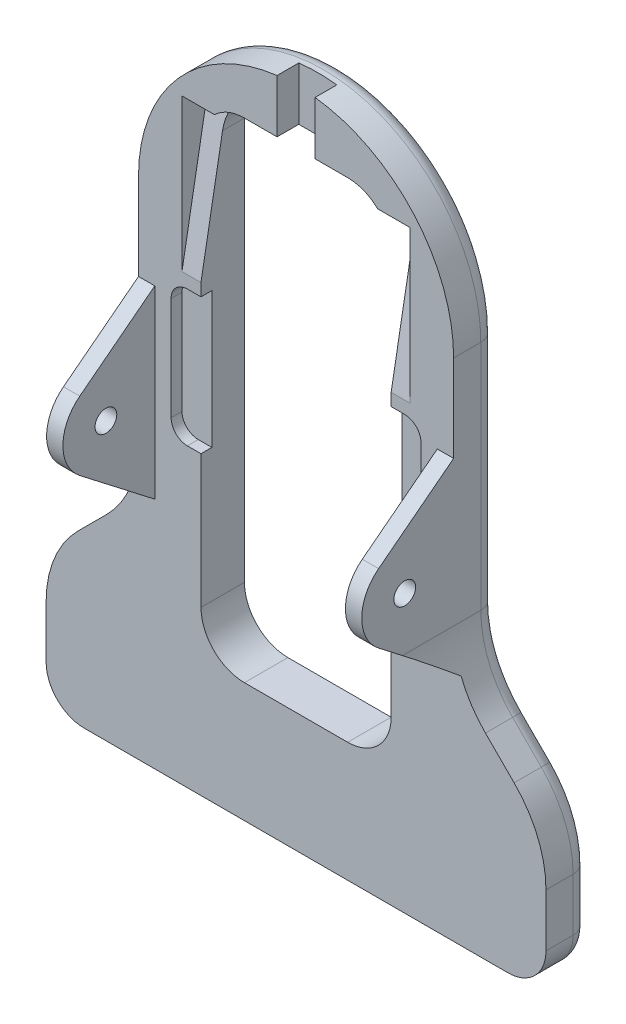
ISO-10303-21;
HEADER;
FILE_DESCRIPTION(('STEP AP214'),'2;1');
FILE_NAME('part.step','',(''),(''),'','','');
FILE_SCHEMA(('AUTOMOTIVE_DESIGN { 1 0 10303 214 1 1 1 1 }'));
ENDSEC;
DATA;
#1=APPLICATION_CONTEXT('core data for automotive mechanical design processes');
#2=APPLICATION_PROTOCOL_DEFINITION('international standard','automotive_design',2000,#1);
#3=PRODUCT_CONTEXT('',#1,'mechanical');
#4=PRODUCT('Part','Part','',(#3));
#5=PRODUCT_RELATED_PRODUCT_CATEGORY('part','',(#4));
#6=PRODUCT_DEFINITION_FORMATION('','',#4);
#7=PRODUCT_DEFINITION_CONTEXT('part definition',#1,'design');
#8=PRODUCT_DEFINITION('design','',#6,#7);
#9=PRODUCT_DEFINITION_SHAPE('','',#8);
#10=(LENGTH_UNIT() NAMED_UNIT(*) SI_UNIT(.MILLI.,.METRE.));
#11=(NAMED_UNIT(*) PLANE_ANGLE_UNIT() SI_UNIT($,.RADIAN.));
#12=(NAMED_UNIT(*) SI_UNIT($,.STERADIAN.) SOLID_ANGLE_UNIT());
#13=UNCERTAINTY_MEASURE_WITH_UNIT(LENGTH_MEASURE(1.E-05),#10,'distance_accuracy_value','');
#14=(GEOMETRIC_REPRESENTATION_CONTEXT(3) GLOBAL_UNCERTAINTY_ASSIGNED_CONTEXT((#13)) GLOBAL_UNIT_ASSIGNED_CONTEXT((#10,
#11,#12)) REPRESENTATION_CONTEXT('',''));
#15=CARTESIAN_POINT('',(0.,0.,0.));
#16=DIRECTION('',(0.,0.,1.));
#17=DIRECTION('',(1.,0.,0.));
#18=AXIS2_PLACEMENT_3D('',#15,#16,#17);
#19=CARTESIAN_POINT('',(29.,43.,8.));
#20=DIRECTION('',(0.,0.791285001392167,-0.611447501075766));
#21=DIRECTION('',(0.,0.611447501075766,0.791285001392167));
#22=AXIS2_PLACEMENT_3D('',#19,#20,#21);
#23=PLANE('',#22);
#24=DIRECTION('',(0.,0.611447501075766,0.791285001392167));
#25=VECTOR('',#24,1.);
#26=CARTESIAN_POINT('',(-26.,43.,7.99999999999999));
#27=LINE('',#26,#25);
#28=CARTESIAN_POINT('',(-26.,43.,7.99999999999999));
#29=VERTEX_POINT('',#28);
#30=CARTESIAN_POINT('',(-26.,53.6697199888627,21.8078729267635));
#31=VERTEX_POINT('',#30);
#32=EDGE_CURVE('E640',#29,#31,#27,.T.);
#33=ORIENTED_EDGE('',*,*,#32,.T.);
#34=DIRECTION('',(-1.,0.,0.));
#35=VECTOR('',#34,1.);
#36=CARTESIAN_POINT('',(29.,53.6697199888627,21.8078729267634));
#37=LINE('',#36,#35);
#38=CARTESIAN_POINT('',(-29.,53.6697199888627,21.8078729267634));
#39=VERTEX_POINT('',#38);
#40=EDGE_CURVE('E756',#31,#39,#37,.T.);
#41=ORIENTED_EDGE('',*,*,#40,.T.);
#42=DIRECTION('',(0.,-0.611447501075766,-0.791285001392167));
#43=VECTOR('',#42,1.);
#44=CARTESIAN_POINT('',(-29.,43.,8.));
#45=LINE('',#44,#43);
#46=CARTESIAN_POINT('',(-29.,50.2842712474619,17.4267039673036));
#47=VERTEX_POINT('',#46);
#48=EDGE_CURVE('E643',#39,#47,#45,.T.);
#49=ORIENTED_EDGE('',*,*,#48,.T.);
#50=CARTESIAN_POINT('',(-49.,50.2842712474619,17.4267039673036));
#51=DIRECTION('',(0.,0.791285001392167,-0.611447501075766));
#52=DIRECTION('',(0.,0.611447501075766,0.791285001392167));
#53=AXIS2_PLACEMENT_3D('',#50,#51,#52);
#54=ELLIPSE('',#53,32.7092677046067,20.);
#55=CARTESIAN_POINT('',(-30.3736908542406,43.,8.));
#56=VERTEX_POINT('',#55);
#57=EDGE_CURVE('E731',#47,#56,#54,.T.);
#58=ORIENTED_EDGE('',*,*,#57,.T.);
#59=DIRECTION('',(-1.,0.,0.));
#60=VECTOR('',#59,1.);
#61=CARTESIAN_POINT('',(29.,43.,8.));
#62=LINE('',#61,#60);
#63=EDGE_CURVE('E658',#29,#56,#62,.T.);
#64=ORIENTED_EDGE('',*,*,#63,.F.);
#65=EDGE_LOOP('',(#33,#41,#49,#58,#64));
#66=FACE_BOUND('',#65,.T.);
#67=ADVANCED_FACE('F37',(#66),#23,.F.);
#68=CARTESIAN_POINT('',(29.,60.,30.));
#69=DIRECTION('',(0.,-0.791285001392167,-0.611447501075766));
#70=DIRECTION('',(0.,0.611447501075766,-0.791285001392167));
#71=AXIS2_PLACEMENT_3D('',#68,#69,#70);
#72=PLANE('',#71);
#73=DIRECTION('',(0.,-0.611447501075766,0.791285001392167));
#74=VECTOR('',#73,1.);
#75=CARTESIAN_POINT('',(-29.,60.,30.));
#76=LINE('',#75,#74);
#77=CARTESIAN_POINT('',(-29.,77.,8.));
#78=VERTEX_POINT('',#77);
#79=CARTESIAN_POINT('',(-29.,66.3302800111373,21.8078729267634));
#80=VERTEX_POINT('',#79);
#81=EDGE_CURVE('E647',#78,#80,#76,.T.);
#82=ORIENTED_EDGE('',*,*,#81,.T.);
#83=DIRECTION('',(-1.,0.,0.));
#84=VECTOR('',#83,1.);
#85=CARTESIAN_POINT('',(29.,66.3302800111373,21.8078729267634));
#86=LINE('',#85,#84);
#87=CARTESIAN_POINT('',(-26.,66.3302800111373,21.8078729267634));
#88=VERTEX_POINT('',#87);
#89=EDGE_CURVE('E761',#80,#88,#86,.F.);
#90=ORIENTED_EDGE('',*,*,#89,.T.);
#91=DIRECTION('',(0.,0.611447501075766,-0.791285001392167));
#92=VECTOR('',#91,1.);
#93=CARTESIAN_POINT('',(-26.,60.,30.));
#94=LINE('',#93,#92);
#95=CARTESIAN_POINT('',(-26.,77.,7.99999999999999));
#96=VERTEX_POINT('',#95);
#97=EDGE_CURVE('E695',#88,#96,#94,.T.);
#98=ORIENTED_EDGE('',*,*,#97,.T.);
#99=DIRECTION('',(-1.,0.,0.));
#100=VECTOR('',#99,1.);
#101=CARTESIAN_POINT('',(29.,77.,8.));
#102=LINE('',#101,#100);
#103=EDGE_CURVE('E650',#96,#78,#102,.T.);
#104=ORIENTED_EDGE('',*,*,#103,.T.);
#105=EDGE_LOOP('',(#82,#90,#98,#104));
#106=FACE_BOUND('',#105,.T.);
#107=ADVANCED_FACE('F954',(#106),#72,.F.);
#108=CARTESIAN_POINT('',(-46.,0.,8.));
#109=DIRECTION('',(1.,0.,0.));
#110=DIRECTION('',(0.,0.,-1.));
#111=AXIS2_PLACEMENT_3D('',#108,#109,#110);
#112=PLANE('',#111);
#113=DIRECTION('',(0.,0.,-1.));
#114=VECTOR('',#113,1.);
#115=CARTESIAN_POINT('',(-46.,16.7157287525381,8.));
#116=LINE('',#115,#114);
#117=CARTESIAN_POINT('',(-46.,16.7157287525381,8.));
#118=VERTEX_POINT('',#117);
#119=CARTESIAN_POINT('',(-46.,16.7157287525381,3.));
#120=VERTEX_POINT('',#119);
#121=EDGE_CURVE('E718',#118,#120,#116,.T.);
#122=ORIENTED_EDGE('',*,*,#121,.T.);
#123=DIRECTION('',(0.,-1.,0.));
#124=VECTOR('',#123,1.);
#125=CARTESIAN_POINT('',(-46.,6.99999999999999,3.));
#126=LINE('',#125,#124);
#127=CARTESIAN_POINT('',(-46.,6.99999999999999,3.));
#128=VERTEX_POINT('',#127);
#129=EDGE_CURVE('E818',#120,#128,#126,.T.);
#130=ORIENTED_EDGE('',*,*,#129,.T.);
#131=DIRECTION('',(0.,0.,-1.));
#132=VECTOR('',#131,1.);
#133=CARTESIAN_POINT('',(-46.,6.99999999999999,8.));
#134=LINE('',#133,#132);
#135=CARTESIAN_POINT('',(-46.,6.99999999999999,8.));
#136=VERTEX_POINT('',#135);
#137=EDGE_CURVE('E747',#128,#136,#134,.F.);
#138=ORIENTED_EDGE('',*,*,#137,.T.);
#139=DIRECTION('',(0.,-1.,0.));
#140=VECTOR('',#139,1.);
#141=CARTESIAN_POINT('',(-46.,0.,8.));
#142=LINE('',#141,#140);
#143=EDGE_CURVE('E662',#118,#136,#142,.T.);
#144=ORIENTED_EDGE('',*,*,#143,.F.);
#145=EDGE_LOOP('',(#122,#130,#138,#144));
#146=FACE_BOUND('',#145,.T.);
#147=ADVANCED_FACE('F961',(#146),#112,.F.);
#148=CARTESIAN_POINT('',(46.,0.,8.));
#149=DIRECTION('',(0.,1.,0.));
#150=DIRECTION('',(-1.,0.,0.));
#151=AXIS2_PLACEMENT_3D('',#148,#149,#150);
#152=PLANE('',#151);
#153=DIRECTION('',(0.,0.,-1.));
#154=VECTOR('',#153,1.);
#155=CARTESIAN_POINT('',(-39.,0.,8.));
#156=LINE('',#155,#154);
#157=CARTESIAN_POINT('',(-39.,0.,8.));
#158=VERTEX_POINT('',#157);
#159=CARTESIAN_POINT('',(-39.,0.,3.));
#160=VERTEX_POINT('',#159);
#161=EDGE_CURVE('E744',#158,#160,#156,.T.);
#162=ORIENTED_EDGE('',*,*,#161,.T.);
#163=DIRECTION('',(1.,0.,0.));
#164=VECTOR('',#163,1.);
#165=CARTESIAN_POINT('',(39.,0.,3.));
#166=LINE('',#165,#164);
#167=CARTESIAN_POINT('',(39.,0.,3.));
#168=VERTEX_POINT('',#167);
#169=EDGE_CURVE('E814',#160,#168,#166,.T.);
#170=ORIENTED_EDGE('',*,*,#169,.T.);
#171=DIRECTION('',(0.,0.,-1.));
#172=VECTOR('',#171,1.);
#173=CARTESIAN_POINT('',(39.,0.,8.));
#174=LINE('',#173,#172);
#175=CARTESIAN_POINT('',(39.,0.,8.));
#176=VERTEX_POINT('',#175);
#177=EDGE_CURVE('E742',#168,#176,#174,.F.);
#178=ORIENTED_EDGE('',*,*,#177,.T.);
#179=DIRECTION('',(1.,0.,0.));
#180=VECTOR('',#179,1.);
#181=CARTESIAN_POINT('',(46.,0.,8.));
#182=LINE('',#181,#180);
#183=EDGE_CURVE('E665',#158,#176,#182,.T.);
#184=ORIENTED_EDGE('',*,*,#183,.F.);
#185=EDGE_LOOP('',(#162,#170,#178,#184));
#186=FACE_BOUND('',#185,.T.);
#187=ADVANCED_FACE('F1224',(#186),#152,.F.);
#188=CARTESIAN_POINT('',(46.,0.,8.));
#189=DIRECTION('',(-1.,0.,0.));
#190=DIRECTION('',(0.,0.,1.));
#191=AXIS2_PLACEMENT_3D('',#188,#189,#190);
#192=PLANE('',#191);
#193=DIRECTION('',(0.,0.,-1.));
#194=VECTOR('',#193,1.);
#195=CARTESIAN_POINT('',(46.,6.99999999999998,8.));
#196=LINE('',#195,#194);
#197=CARTESIAN_POINT('',(46.,6.99999999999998,8.));
#198=VERTEX_POINT('',#197);
#199=CARTESIAN_POINT('',(46.,6.99999999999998,3.));
#200=VERTEX_POINT('',#199);
#201=EDGE_CURVE('E753',#198,#200,#196,.T.);
#202=ORIENTED_EDGE('',*,*,#201,.T.);
#203=DIRECTION('',(0.,1.,0.));
#204=VECTOR('',#203,1.);
#205=CARTESIAN_POINT('',(46.,16.7157287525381,3.));
#206=LINE('',#205,#204);
#207=CARTESIAN_POINT('',(46.,16.7157287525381,3.));
#208=VERTEX_POINT('',#207);
#209=EDGE_CURVE('E810',#200,#208,#206,.T.);
#210=ORIENTED_EDGE('',*,*,#209,.T.);
#211=DIRECTION('',(0.,0.,-1.));
#212=VECTOR('',#211,1.);
#213=CARTESIAN_POINT('',(46.,16.7157287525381,8.));
#214=LINE('',#213,#212);
#215=CARTESIAN_POINT('',(46.,16.7157287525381,8.));
#216=VERTEX_POINT('',#215);
#217=EDGE_CURVE('E712',#208,#216,#214,.F.);
#218=ORIENTED_EDGE('',*,*,#217,.T.);
#219=DIRECTION('',(0.,1.,0.));
#220=VECTOR('',#219,1.);
#221=CARTESIAN_POINT('',(46.,0.,8.));
#222=LINE('',#221,#220);
#223=EDGE_CURVE('E668',#198,#216,#222,.T.);
#224=ORIENTED_EDGE('',*,*,#223,.F.);
#225=EDGE_LOOP('',(#202,#210,#218,#224));
#226=FACE_BOUND('',#225,.T.);
#227=ADVANCED_FACE('F1234',(#226),#192,.F.);
#228=CARTESIAN_POINT('',(46.,25.,8.));
#229=DIRECTION('',(-0.707106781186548,-0.707106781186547,0.));
#230=DIRECTION('',(0.707106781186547,-0.707106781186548,0.));
#231=AXIS2_PLACEMENT_3D('',#228,#229,#230);
#232=PLANE('',#231);
#233=DIRECTION('',(0.,0.,-1.));
#234=VECTOR('',#233,1.);
#235=CARTESIAN_POINT('',(40.142135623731,30.857864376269,8.));
#236=LINE('',#235,#234);
#237=CARTESIAN_POINT('',(40.142135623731,30.857864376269,8.));
#238=VERTEX_POINT('',#237);
#239=CARTESIAN_POINT('',(40.142135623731,30.857864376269,3.));
#240=VERTEX_POINT('',#239);
#241=EDGE_CURVE('E709',#238,#240,#236,.T.);
#242=ORIENTED_EDGE('',*,*,#241,.T.);
#243=DIRECTION('',(-0.707106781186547,0.707106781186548,0.));
#244=VECTOR('',#243,1.);
#245=CARTESIAN_POINT('',(34.857864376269,36.1421356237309,3.));
#246=LINE('',#245,#244);
#247=CARTESIAN_POINT('',(34.857864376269,36.1421356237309,3.));
#248=VERTEX_POINT('',#247);
#249=EDGE_CURVE('E806',#240,#248,#246,.T.);
#250=ORIENTED_EDGE('',*,*,#249,.T.);
#251=DIRECTION('',(0.,0.,-1.));
#252=VECTOR('',#251,1.);
#253=CARTESIAN_POINT('',(34.857864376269,36.1421356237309,8.));
#254=LINE('',#253,#252);
#255=CARTESIAN_POINT('',(34.857864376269,36.1421356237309,8.));
#256=VERTEX_POINT('',#255);
#257=EDGE_CURVE('E707',#248,#256,#254,.F.);
#258=ORIENTED_EDGE('',*,*,#257,.T.);
#259=DIRECTION('',(-0.707106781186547,0.707106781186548,0.));
#260=VECTOR('',#259,1.);
#261=CARTESIAN_POINT('',(46.,25.,8.));
#262=LINE('',#261,#260);
#263=EDGE_CURVE('E671',#238,#256,#262,.T.);
#264=ORIENTED_EDGE('',*,*,#263,.F.);
#265=EDGE_LOOP('',(#242,#250,#258,#264));
#266=FACE_BOUND('',#265,.T.);
#267=ADVANCED_FACE('F1244',(#266),#232,.F.);
#268=CARTESIAN_POINT('',(29.,42.,8.));
#269=DIRECTION('',(-1.,0.,0.));
#270=DIRECTION('',(0.,0.,1.));
#271=AXIS2_PLACEMENT_3D('',#268,#269,#270);
#272=PLANE('',#271);
#273=CARTESIAN_POINT('',(29.,60.,17.));
#274=DIRECTION('',(1.,0.,0.));
#275=DIRECTION('',(0.,0.,-1.));
#276=AXIS2_PLACEMENT_3D('',#273,#274,#275);
#277=CIRCLE('',#276,2.);
#278=CARTESIAN_POINT('',(29.,60.,15.));
#279=VERTEX_POINT('',#278);
#280=EDGE_CURVE('E603',#279,#279,#277,.T.);
#281=ORIENTED_EDGE('',*,*,#280,.F.);
#282=EDGE_LOOP('',(#281));
#283=FACE_BOUND('',#282,.T.);
#284=DIRECTION('',(0.,0.,-1.));
#285=VECTOR('',#284,1.);
#286=CARTESIAN_POINT('',(29.,50.2842712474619,0.));
#287=LINE('',#286,#285);
#288=CARTESIAN_POINT('',(29.,50.2842712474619,17.4267039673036));
#289=VERTEX_POINT('',#288);
#290=CARTESIAN_POINT('',(29.,50.2842712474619,3.));
#291=VERTEX_POINT('',#290);
#292=EDGE_CURVE('E728',#289,#291,#287,.T.);
#293=ORIENTED_EDGE('',*,*,#292,.T.);
#294=DIRECTION('',(0.,1.,0.));
#295=VECTOR('',#294,1.);
#296=CARTESIAN_POINT('',(29.,92.9999999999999,3.));
#297=LINE('',#296,#295);
#298=CARTESIAN_POINT('',(29.,92.9999999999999,3.));
#299=VERTEX_POINT('',#298);
#300=EDGE_CURVE('E830',#291,#299,#297,.T.);
#301=ORIENTED_EDGE('',*,*,#300,.T.);
#302=DIRECTION('',(0.,0.,-1.));
#303=VECTOR('',#302,1.);
#304=CARTESIAN_POINT('',(29.,92.9999999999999,8.));
#305=LINE('',#304,#303);
#306=CARTESIAN_POINT('',(29.,92.9999999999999,8.));
#307=VERTEX_POINT('',#306);
#308=EDGE_CURVE('E689',#307,#299,#305,.T.);
#309=ORIENTED_EDGE('',*,*,#308,.F.);
#310=DIRECTION('',(0.,1.,0.));
#311=VECTOR('',#310,1.);
#312=CARTESIAN_POINT('',(29.,42.,8.));
#313=LINE('',#312,#311);
#314=CARTESIAN_POINT('',(29.,77.,8.));
#315=VERTEX_POINT('',#314);
#316=EDGE_CURVE('E674',#315,#307,#313,.T.);
#317=ORIENTED_EDGE('',*,*,#316,.F.);
#318=DIRECTION('',(0.,-0.611447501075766,0.791285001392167));
#319=VECTOR('',#318,1.);
#320=CARTESIAN_POINT('',(29.,60.,30.));
#321=LINE('',#320,#319);
#322=CARTESIAN_POINT('',(29.,66.3302800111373,21.8078729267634));
#323=VERTEX_POINT('',#322);
#324=EDGE_CURVE('E646',#315,#323,#321,.T.);
#325=ORIENTED_EDGE('',*,*,#324,.T.);
#326=CARTESIAN_POINT('',(29.,60.,16.9162929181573));
#327=DIRECTION('',(-1.,0.,0.));
#328=DIRECTION('',(0.,0.,1.));
#329=AXIS2_PLACEMENT_3D('',#326,#327,#328);
#330=CIRCLE('',#329,8.);
#331=CARTESIAN_POINT('',(29.,53.6697199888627,21.8078729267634));
#332=VERTEX_POINT('',#331);
#333=EDGE_CURVE('E772',#323,#332,#330,.F.);
#334=ORIENTED_EDGE('',*,*,#333,.T.);
#335=DIRECTION('',(0.,-0.611447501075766,-0.791285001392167));
#336=VECTOR('',#335,1.);
#337=CARTESIAN_POINT('',(29.,43.,8.));
#338=LINE('',#337,#336);
#339=EDGE_CURVE('E644',#332,#289,#338,.T.);
#340=ORIENTED_EDGE('',*,*,#339,.T.);
#341=EDGE_LOOP('',(#293,#301,#309,#317,#325,#334,#340));
#342=FACE_BOUND('',#341,.T.);
#343=ADVANCED_FACE('F992',(#283,#342),#272,.F.);
#344=CARTESIAN_POINT('',(0.,93.,8.));
#345=DIRECTION('',(0.,0.,-1.));
#346=DIRECTION('',(-1.,0.,0.));
#347=AXIS2_PLACEMENT_3D('',#344,#345,#346);
#348=CYLINDRICAL_SURFACE('',#347,29.);
#349=ORIENTED_EDGE('',*,*,#308,.T.);
#350=CARTESIAN_POINT('',(0.,93.,3.));
#351=DIRECTION('',(0.,0.,-1.));
#352=DIRECTION('',(-1.,0.,0.));
#353=AXIS2_PLACEMENT_3D('',#350,#351,#352);
#354=CIRCLE('',#353,29.);
#355=CARTESIAN_POINT('',(-29.,93.,3.));
#356=VERTEX_POINT('',#355);
#357=EDGE_CURVE('E828',#299,#356,#354,.F.);
#358=ORIENTED_EDGE('',*,*,#357,.T.);
#359=DIRECTION('',(0.,0.,-1.));
#360=VECTOR('',#359,1.);
#361=CARTESIAN_POINT('',(-29.,93.,8.));
#362=LINE('',#361,#360);
#363=CARTESIAN_POINT('',(-29.,93.,8.));
#364=VERTEX_POINT('',#363);
#365=EDGE_CURVE('E686',#364,#356,#362,.T.);
#366=ORIENTED_EDGE('',*,*,#365,.F.);
#367=CARTESIAN_POINT('',(0.,93.,8.));
#368=DIRECTION('',(0.,0.,1.));
#369=DIRECTION('',(-1.,0.,0.));
#370=AXIS2_PLACEMENT_3D('',#367,#368,#369);
#371=CIRCLE('',#370,29.);
#372=CARTESIAN_POINT('',(-3.5,121.78801834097,8.));
#373=VERTEX_POINT('',#372);
#374=EDGE_CURVE('E676',#373,#364,#371,.T.);
#375=ORIENTED_EDGE('',*,*,#374,.F.);
#376=DIRECTION('',(0.,0.,-1.));
#377=VECTOR('',#376,1.);
#378=CARTESIAN_POINT('',(-3.5,121.78801834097,8.));
#379=LINE('',#378,#377);
#380=CARTESIAN_POINT('',(-3.5,121.78801834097,4.));
#381=VERTEX_POINT('',#380);
#382=EDGE_CURVE('E475',#373,#381,#379,.T.);
#383=ORIENTED_EDGE('',*,*,#382,.T.);
#384=CARTESIAN_POINT('',(0.,93.,4.));
#385=DIRECTION('',(0.,0.,1.));
#386=DIRECTION('',(1.,0.,0.));
#387=AXIS2_PLACEMENT_3D('',#384,#385,#386);
#388=CIRCLE('',#387,29.);
#389=CARTESIAN_POINT('',(3.5,121.78801834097,4.));
#390=VERTEX_POINT('',#389);
#391=EDGE_CURVE('E468',#390,#381,#388,.T.);
#392=ORIENTED_EDGE('',*,*,#391,.F.);
#393=DIRECTION('',(0.,0.,-1.));
#394=VECTOR('',#393,1.);
#395=CARTESIAN_POINT('',(3.5,121.78801834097,8.));
#396=LINE('',#395,#394);
#397=CARTESIAN_POINT('',(3.5,121.78801834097,8.));
#398=VERTEX_POINT('',#397);
#399=EDGE_CURVE('E472',#390,#398,#396,.F.);
#400=ORIENTED_EDGE('',*,*,#399,.T.);
#401=EDGE_CURVE('E677',#307,#398,#371,.T.);
#402=ORIENTED_EDGE('',*,*,#401,.F.);
#403=EDGE_LOOP('',(#349,#358,#366,#375,#383,#392,#400,#402));
#404=FACE_BOUND('',#403,.T.);
#405=ADVANCED_FACE('F997',(#404),#348,.T.);
#406=CARTESIAN_POINT('',(-29.,42.,8.));
#407=DIRECTION('',(1.,0.,0.));
#408=DIRECTION('',(0.,0.,-1.));
#409=AXIS2_PLACEMENT_3D('',#406,#407,#408);
#410=PLANE('',#409);
#411=CARTESIAN_POINT('',(-29.,60.,17.));
#412=DIRECTION('',(1.,0.,0.));
#413=DIRECTION('',(0.,0.,-1.));
#414=AXIS2_PLACEMENT_3D('',#411,#412,#413);
#415=CIRCLE('',#414,2.);
#416=CARTESIAN_POINT('',(-29.,60.,15.));
#417=VERTEX_POINT('',#416);
#418=EDGE_CURVE('E625',#417,#417,#415,.F.);
#419=ORIENTED_EDGE('',*,*,#418,.F.);
#420=EDGE_LOOP('',(#419));
#421=FACE_BOUND('',#420,.T.);
#422=ORIENTED_EDGE('',*,*,#365,.T.);
#423=DIRECTION('',(0.,-1.,0.));
#424=VECTOR('',#423,1.);
#425=CARTESIAN_POINT('',(-29.,50.2842712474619,3.));
#426=LINE('',#425,#424);
#427=CARTESIAN_POINT('',(-29.,50.2842712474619,3.));
#428=VERTEX_POINT('',#427);
#429=EDGE_CURVE('E826',#356,#428,#426,.T.);
#430=ORIENTED_EDGE('',*,*,#429,.T.);
#431=DIRECTION('',(0.,0.,-1.));
#432=VECTOR('',#431,1.);
#433=CARTESIAN_POINT('',(-29.,50.2842712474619,8.));
#434=LINE('',#433,#432);
#435=EDGE_CURVE('E726',#428,#47,#434,.F.);
#436=ORIENTED_EDGE('',*,*,#435,.T.);
#437=ORIENTED_EDGE('',*,*,#48,.F.);
#438=CARTESIAN_POINT('',(-29.,60.,16.9162929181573));
#439=DIRECTION('',(1.,0.,0.));
#440=DIRECTION('',(0.,0.,-1.));
#441=AXIS2_PLACEMENT_3D('',#438,#439,#440);
#442=CIRCLE('',#441,8.);
#443=EDGE_CURVE('E759',#39,#80,#442,.F.);
#444=ORIENTED_EDGE('',*,*,#443,.T.);
#445=ORIENTED_EDGE('',*,*,#81,.F.);
#446=DIRECTION('',(0.,-1.,0.));
#447=VECTOR('',#446,1.);
#448=CARTESIAN_POINT('',(-29.,42.,8.));
#449=LINE('',#448,#447);
#450=EDGE_CURVE('E680',#364,#78,#449,.T.);
#451=ORIENTED_EDGE('',*,*,#450,.F.);
#452=EDGE_LOOP('',(#422,#430,#436,#437,#444,#445,#451));
#453=FACE_BOUND('',#452,.T.);
#454=ADVANCED_FACE('F1274',(#421,#453),#410,.F.);
#455=CARTESIAN_POINT('',(-46.,25.,8.));
#456=DIRECTION('',(0.707106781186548,-0.707106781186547,0.));
#457=DIRECTION('',(0.707106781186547,0.707106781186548,0.));
#458=AXIS2_PLACEMENT_3D('',#455,#456,#457);
#459=PLANE('',#458);
#460=DIRECTION('',(0.,0.,-1.));
#461=VECTOR('',#460,1.);
#462=CARTESIAN_POINT('',(-34.857864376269,36.142135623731,0.));
#463=LINE('',#462,#461);
#464=CARTESIAN_POINT('',(-34.857864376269,36.142135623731,8.));
#465=VERTEX_POINT('',#464);
#466=CARTESIAN_POINT('',(-34.857864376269,36.142135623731,3.));
#467=VERTEX_POINT('',#466);
#468=EDGE_CURVE('E721',#465,#467,#463,.T.);
#469=ORIENTED_EDGE('',*,*,#468,.T.);
#470=DIRECTION('',(-0.707106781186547,-0.707106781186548,0.));
#471=VECTOR('',#470,1.);
#472=CARTESIAN_POINT('',(-40.142135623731,30.857864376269,3.));
#473=LINE('',#472,#471);
#474=CARTESIAN_POINT('',(-40.142135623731,30.857864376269,3.));
#475=VERTEX_POINT('',#474);
#476=EDGE_CURVE('E822',#467,#475,#473,.T.);
#477=ORIENTED_EDGE('',*,*,#476,.T.);
#478=DIRECTION('',(0.,0.,-1.));
#479=VECTOR('',#478,1.);
#480=CARTESIAN_POINT('',(-40.142135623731,30.857864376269,8.));
#481=LINE('',#480,#479);
#482=CARTESIAN_POINT('',(-40.142135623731,30.857864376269,8.));
#483=VERTEX_POINT('',#482);
#484=EDGE_CURVE('E724',#475,#483,#481,.F.);
#485=ORIENTED_EDGE('',*,*,#484,.T.);
#486=DIRECTION('',(-0.707106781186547,-0.707106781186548,0.));
#487=VECTOR('',#486,1.);
#488=CARTESIAN_POINT('',(-46.,25.,8.));
#489=LINE('',#488,#487);
#490=EDGE_CURVE('E683',#465,#483,#489,.T.);
#491=ORIENTED_EDGE('',*,*,#490,.F.);
#492=EDGE_LOOP('',(#469,#477,#485,#491));
#493=FACE_BOUND('',#492,.T.);
#494=ADVANCED_FACE('F1283',(#493),#459,.F.);
#495=CARTESIAN_POINT('',(0.,93.,8.));
#496=DIRECTION('',(0.,0.,-1.));
#497=DIRECTION('',(-1.,0.,0.));
#498=AXIS2_PLACEMENT_3D('',#495,#496,#497);
#499=PLANE('',#498);
#500=DIRECTION('',(0.,-1.,0.));
#501=VECTOR('',#500,1.);
#502=CARTESIAN_POINT('',(-17.5,104.,8.));
#503=LINE('',#502,#501);
#504=CARTESIAN_POINT('',(-17.5,81.7880183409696,8.));
#505=VERTEX_POINT('',#504);
#506=CARTESIAN_POINT('',(-17.5,79.5,8.));
#507=VERTEX_POINT('',#506);
#508=EDGE_CURVE('E594',#505,#507,#503,.T.);
#509=ORIENTED_EDGE('',*,*,#508,.F.);
#510=DIRECTION('',(1.,0.,0.));
#511=VECTOR('',#510,1.);
#512=CARTESIAN_POINT('',(-21.,81.7880183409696,8.));
#513=LINE('',#512,#511);
#514=CARTESIAN_POINT('',(-21.,81.7880183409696,8.));
#515=VERTEX_POINT('',#514);
#516=EDGE_CURVE('E439',#515,#505,#513,.T.);
#517=ORIENTED_EDGE('',*,*,#516,.F.);
#518=DIRECTION('',(0.,-1.,0.));
#519=VECTOR('',#518,1.);
#520=CARTESIAN_POINT('',(-21.,81.7880183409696,8.));
#521=LINE('',#520,#519);
#522=CARTESIAN_POINT('',(-21.,109.78801834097,8.));
#523=VERTEX_POINT('',#522);
#524=EDGE_CURVE('E424',#523,#515,#521,.T.);
#525=ORIENTED_EDGE('',*,*,#524,.F.);
#526=DIRECTION('',(1.,0.,0.));
#527=VECTOR('',#526,1.);
#528=CARTESIAN_POINT('',(-21.,109.78801834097,8.));
#529=LINE('',#528,#527);
#530=CARTESIAN_POINT('',(-15.022575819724,109.78801834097,8.));
#531=VERTEX_POINT('',#530);
#532=EDGE_CURVE('E421',#523,#531,#529,.T.);
#533=ORIENTED_EDGE('',*,*,#532,.T.);
#534=CARTESIAN_POINT('',(-9.5,104.,8.));
#535=DIRECTION('',(0.,0.,1.));
#536=DIRECTION('',(1.,0.,0.));
#537=AXIS2_PLACEMENT_3D('',#534,#535,#536);
#538=CIRCLE('',#537,8.);
#539=CARTESIAN_POINT('',(-9.5,112.,8.));
#540=VERTEX_POINT('',#539);
#541=EDGE_CURVE('E590',#540,#531,#538,.T.);
#542=ORIENTED_EDGE('',*,*,#541,.F.);
#543=DIRECTION('',(-1.,0.,0.));
#544=VECTOR('',#543,1.);
#545=CARTESIAN_POINT('',(-9.5,112.,8.));
#546=LINE('',#545,#544);
#547=CARTESIAN_POINT('',(-3.5,112.,8.));
#548=VERTEX_POINT('',#547);
#549=EDGE_CURVE('E586',#548,#540,#546,.T.);
#550=ORIENTED_EDGE('',*,*,#549,.F.);
#551=DIRECTION('',(0.,-1.,0.));
#552=VECTOR('',#551,1.);
#553=CARTESIAN_POINT('',(-3.5,122.,8.));
#554=LINE('',#553,#552);
#555=EDGE_CURVE('E462',#373,#548,#554,.T.);
#556=ORIENTED_EDGE('',*,*,#555,.F.);
#557=ORIENTED_EDGE('',*,*,#374,.T.);
#558=ORIENTED_EDGE('',*,*,#450,.T.);
#559=ORIENTED_EDGE('',*,*,#103,.F.);
#560=DIRECTION('',(0.,-1.,0.));
#561=VECTOR('',#560,1.);
#562=CARTESIAN_POINT('',(-26.,122.,7.99999999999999));
#563=LINE('',#562,#561);
#564=EDGE_CURVE('E632',#96,#29,#563,.T.);
#565=ORIENTED_EDGE('',*,*,#564,.T.);
#566=ORIENTED_EDGE('',*,*,#63,.T.);
#567=CARTESIAN_POINT('',(-49.,50.2842712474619,8.));
#568=DIRECTION('',(0.,0.,-1.));
#569=DIRECTION('',(-1.,0.,0.));
#570=AXIS2_PLACEMENT_3D('',#567,#568,#569);
#571=CIRCLE('',#570,20.);
#572=EDGE_CURVE('E734',#56,#465,#571,.T.);
#573=ORIENTED_EDGE('',*,*,#572,.T.);
#574=ORIENTED_EDGE('',*,*,#490,.T.);
#575=CARTESIAN_POINT('',(-26.,16.7157287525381,8.));
#576=DIRECTION('',(0.,0.,-1.));
#577=DIRECTION('',(-1.,0.,0.));
#578=AXIS2_PLACEMENT_3D('',#575,#576,#577);
#579=CIRCLE('',#578,20.);
#580=EDGE_CURVE('E714',#483,#118,#579,.F.);
#581=ORIENTED_EDGE('',*,*,#580,.T.);
#582=ORIENTED_EDGE('',*,*,#143,.T.);
#583=CARTESIAN_POINT('',(-39.,6.99999999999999,8.));
#584=DIRECTION('',(0.,0.,-1.));
#585=DIRECTION('',(-1.,0.,0.));
#586=AXIS2_PLACEMENT_3D('',#583,#584,#585);
#587=CIRCLE('',#586,7.);
#588=EDGE_CURVE('E751',#136,#158,#587,.F.);
#589=ORIENTED_EDGE('',*,*,#588,.T.);
#590=ORIENTED_EDGE('',*,*,#183,.T.);
#591=CARTESIAN_POINT('',(39.,6.99999999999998,8.));
#592=DIRECTION('',(0.,0.,-1.));
#593=DIRECTION('',(-1.,0.,0.));
#594=AXIS2_PLACEMENT_3D('',#591,#592,#593);
#595=CIRCLE('',#594,7.);
#596=EDGE_CURVE('E749',#176,#198,#595,.F.);
#597=ORIENTED_EDGE('',*,*,#596,.T.);
#598=ORIENTED_EDGE('',*,*,#223,.T.);
#599=CARTESIAN_POINT('',(26.,16.7157287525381,8.));
#600=DIRECTION('',(0.,0.,-1.));
#601=DIRECTION('',(-1.,0.,0.));
#602=AXIS2_PLACEMENT_3D('',#599,#600,#601);
#603=CIRCLE('',#602,20.);
#604=EDGE_CURVE('E716',#216,#238,#603,.F.);
#605=ORIENTED_EDGE('',*,*,#604,.T.);
#606=ORIENTED_EDGE('',*,*,#263,.T.);
#607=CARTESIAN_POINT('',(49.,50.2842712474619,8.));
#608=DIRECTION('',(0.,0.,-1.));
#609=DIRECTION('',(-1.,0.,0.));
#610=AXIS2_PLACEMENT_3D('',#607,#608,#609);
#611=CIRCLE('',#610,20.);
#612=CARTESIAN_POINT('',(30.3736908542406,43.,8.));
#613=VERTEX_POINT('',#612);
#614=EDGE_CURVE('E736',#256,#613,#611,.T.);
#615=ORIENTED_EDGE('',*,*,#614,.T.);
#616=CARTESIAN_POINT('',(26.,43.,8.));
#617=VERTEX_POINT('',#616);
#618=EDGE_CURVE('E659',#613,#617,#62,.T.);
#619=ORIENTED_EDGE('',*,*,#618,.T.);
#620=DIRECTION('',(0.,-1.,0.));
#621=VECTOR('',#620,1.);
#622=CARTESIAN_POINT('',(26.,122.,8.));
#623=LINE('',#622,#621);
#624=CARTESIAN_POINT('',(26.,77.,8.));
#625=VERTEX_POINT('',#624);
#626=EDGE_CURVE('E633',#625,#617,#623,.T.);
#627=ORIENTED_EDGE('',*,*,#626,.F.);
#628=EDGE_CURVE('E655',#315,#625,#102,.T.);
#629=ORIENTED_EDGE('',*,*,#628,.F.);
#630=ORIENTED_EDGE('',*,*,#316,.T.);
#631=ORIENTED_EDGE('',*,*,#401,.T.);
#632=DIRECTION('',(0.,1.,0.));
#633=VECTOR('',#632,1.);
#634=CARTESIAN_POINT('',(3.5,122.,8.));
#635=LINE('',#634,#633);
#636=CARTESIAN_POINT('',(3.5,112.,8.));
#637=VERTEX_POINT('',#636);
#638=EDGE_CURVE('E455',#637,#398,#635,.T.);
#639=ORIENTED_EDGE('',*,*,#638,.F.);
#640=CARTESIAN_POINT('',(9.5,112.,8.));
#641=VERTEX_POINT('',#640);
#642=EDGE_CURVE('E587',#641,#637,#546,.T.);
#643=ORIENTED_EDGE('',*,*,#642,.F.);
#644=CARTESIAN_POINT('',(9.5,104.,8.));
#645=DIRECTION('',(0.,0.,1.));
#646=DIRECTION('',(-1.,0.,0.));
#647=AXIS2_PLACEMENT_3D('',#644,#645,#646);
#648=CIRCLE('',#647,8.);
#649=CARTESIAN_POINT('',(15.022575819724,109.78801834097,8.));
#650=VERTEX_POINT('',#649);
#651=EDGE_CURVE('E584',#650,#641,#648,.T.);
#652=ORIENTED_EDGE('',*,*,#651,.F.);
#653=CARTESIAN_POINT('',(21.,109.78801834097,8.));
#654=VERTEX_POINT('',#653);
#655=EDGE_CURVE('E414',#650,#654,#529,.T.);
#656=ORIENTED_EDGE('',*,*,#655,.T.);
#657=DIRECTION('',(0.,-1.,0.));
#658=VECTOR('',#657,1.);
#659=CARTESIAN_POINT('',(21.,81.7880183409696,8.));
#660=LINE('',#659,#658);
#661=CARTESIAN_POINT('',(21.,81.7880183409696,8.));
#662=VERTEX_POINT('',#661);
#663=EDGE_CURVE('E428',#654,#662,#660,.T.);
#664=ORIENTED_EDGE('',*,*,#663,.T.);
#665=CARTESIAN_POINT('',(17.5,81.7880183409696,8.));
#666=VERTEX_POINT('',#665);
#667=EDGE_CURVE('E441',#666,#662,#513,.T.);
#668=ORIENTED_EDGE('',*,*,#667,.F.);
#669=DIRECTION('',(0.,1.,0.));
#670=VECTOR('',#669,1.);
#671=CARTESIAN_POINT('',(17.5,104.,8.));
#672=LINE('',#671,#670);
#673=CARTESIAN_POINT('',(17.5,79.5,8.));
#674=VERTEX_POINT('',#673);
#675=EDGE_CURVE('E580',#674,#666,#672,.T.);
#676=ORIENTED_EDGE('',*,*,#675,.F.);
#677=DIRECTION('',(-1.,0.,0.));
#678=VECTOR('',#677,1.);
#679=CARTESIAN_POINT('',(-20.,79.5,8.));
#680=LINE('',#679,#678);
#681=CARTESIAN_POINT('',(20.,79.5,8.));
#682=VERTEX_POINT('',#681);
#683=EDGE_CURVE('E520',#682,#674,#680,.T.);
#684=ORIENTED_EDGE('',*,*,#683,.F.);
#685=CARTESIAN_POINT('',(20.,76.5,8.));
#686=DIRECTION('',(0.,0.,1.));
#687=DIRECTION('',(-1.,0.,0.));
#688=AXIS2_PLACEMENT_3D('',#685,#686,#687);
#689=CIRCLE('',#688,3.00000000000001);
#690=CARTESIAN_POINT('',(23.,76.5,8.));
#691=VERTEX_POINT('',#690);
#692=EDGE_CURVE('E516',#691,#682,#689,.T.);
#693=ORIENTED_EDGE('',*,*,#692,.F.);
#694=DIRECTION('',(0.,1.,0.));
#695=VECTOR('',#694,1.);
#696=CARTESIAN_POINT('',(23.,76.5,8.));
#697=LINE('',#696,#695);
#698=CARTESIAN_POINT('',(23.,57.5,8.));
#699=VERTEX_POINT('',#698);
#700=EDGE_CURVE('E513',#699,#691,#697,.T.);
#701=ORIENTED_EDGE('',*,*,#700,.F.);
#702=CARTESIAN_POINT('',(20.,57.5,8.));
#703=DIRECTION('',(0.,0.,1.));
#704=DIRECTION('',(1.,0.,0.));
#705=AXIS2_PLACEMENT_3D('',#702,#703,#704);
#706=CIRCLE('',#705,3.);
#707=CARTESIAN_POINT('',(20.,54.5,8.));
#708=VERTEX_POINT('',#707);
#709=EDGE_CURVE('E510',#708,#699,#706,.T.);
#710=ORIENTED_EDGE('',*,*,#709,.F.);
#711=DIRECTION('',(1.,0.,0.));
#712=VECTOR('',#711,1.);
#713=CARTESIAN_POINT('',(-20.,54.5,8.));
#714=LINE('',#713,#712);
#715=CARTESIAN_POINT('',(17.5,54.5,8.));
#716=VERTEX_POINT('',#715);
#717=EDGE_CURVE('E507',#716,#708,#714,.T.);
#718=ORIENTED_EDGE('',*,*,#717,.F.);
#719=CARTESIAN_POINT('',(17.5,30.,8.));
#720=VERTEX_POINT('',#719);
#721=EDGE_CURVE('E581',#720,#716,#672,.T.);
#722=ORIENTED_EDGE('',*,*,#721,.F.);
#723=CARTESIAN_POINT('',(9.50000000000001,30.,8.));
#724=DIRECTION('',(0.,0.,1.));
#725=DIRECTION('',(1.,0.,0.));
#726=AXIS2_PLACEMENT_3D('',#723,#724,#725);
#727=CIRCLE('',#726,7.99999999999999);
#728=CARTESIAN_POINT('',(9.50000000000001,22.,8.));
#729=VERTEX_POINT('',#728);
#730=EDGE_CURVE('E552',#729,#720,#727,.T.);
#731=ORIENTED_EDGE('',*,*,#730,.F.);
#732=DIRECTION('',(1.,0.,0.));
#733=VECTOR('',#732,1.);
#734=CARTESIAN_POINT('',(-9.50000000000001,22.,8.));
#735=LINE('',#734,#733);
#736=CARTESIAN_POINT('',(-9.50000000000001,22.,8.));
#737=VERTEX_POINT('',#736);
#738=EDGE_CURVE('E557',#737,#729,#735,.T.);
#739=ORIENTED_EDGE('',*,*,#738,.F.);
#740=CARTESIAN_POINT('',(-9.50000000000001,30.,8.));
#741=DIRECTION('',(0.,0.,1.));
#742=DIRECTION('',(1.,0.,0.));
#743=AXIS2_PLACEMENT_3D('',#740,#741,#742);
#744=CIRCLE('',#743,7.99999999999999);
#745=CARTESIAN_POINT('',(-17.5,30.,8.));
#746=VERTEX_POINT('',#745);
#747=EDGE_CURVE('E596',#746,#737,#744,.T.);
#748=ORIENTED_EDGE('',*,*,#747,.F.);
#749=CARTESIAN_POINT('',(-17.5,54.5,8.));
#750=VERTEX_POINT('',#749);
#751=EDGE_CURVE('E593',#750,#746,#503,.T.);
#752=ORIENTED_EDGE('',*,*,#751,.F.);
#753=CARTESIAN_POINT('',(-20.,54.5,8.));
#754=VERTEX_POINT('',#753);
#755=EDGE_CURVE('E508',#754,#750,#714,.T.);
#756=ORIENTED_EDGE('',*,*,#755,.F.);
#757=CARTESIAN_POINT('',(-20.,57.5,8.));
#758=DIRECTION('',(0.,0.,1.));
#759=DIRECTION('',(1.,0.,0.));
#760=AXIS2_PLACEMENT_3D('',#757,#758,#759);
#761=CIRCLE('',#760,3.);
#762=CARTESIAN_POINT('',(-23.,57.5,8.));
#763=VERTEX_POINT('',#762);
#764=EDGE_CURVE('E478',#763,#754,#761,.T.);
#765=ORIENTED_EDGE('',*,*,#764,.F.);
#766=DIRECTION('',(0.,-1.,0.));
#767=VECTOR('',#766,1.);
#768=CARTESIAN_POINT('',(-23.,76.5,8.));
#769=LINE('',#768,#767);
#770=CARTESIAN_POINT('',(-23.,76.5,8.));
#771=VERTEX_POINT('',#770);
#772=EDGE_CURVE('E483',#771,#763,#769,.T.);
#773=ORIENTED_EDGE('',*,*,#772,.F.);
#774=CARTESIAN_POINT('',(-20.,76.5,8.));
#775=DIRECTION('',(0.,0.,1.));
#776=DIRECTION('',(1.,0.,0.));
#777=AXIS2_PLACEMENT_3D('',#774,#775,#776);
#778=CIRCLE('',#777,3.00000000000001);
#779=CARTESIAN_POINT('',(-20.,79.5,8.));
#780=VERTEX_POINT('',#779);
#781=EDGE_CURVE('E522',#780,#771,#778,.T.);
#782=ORIENTED_EDGE('',*,*,#781,.F.);
#783=EDGE_CURVE('E519',#507,#780,#680,.T.);
#784=ORIENTED_EDGE('',*,*,#783,.F.);
#785=EDGE_LOOP('',(#509,#517,#525,#533,#542,#550,#556,#557,#558,#559,#565,#566,#573,#574,#581,
#582,#589,#590,#597,#598,#605,#606,#615,#619,#627,#629,#630,#631,#639,#643,#652,#656,#664,#668,
#676,#684,#693,#701,#710,#718,#722,#731,#739,#748,#752,#756,#765,#773,#782,#784));
#786=FACE_BOUND('',#785,.T.);
#787=ADVANCED_FACE('F888',(#786),#499,.F.);
#788=CARTESIAN_POINT('',(0.,93.,0.));
#789=DIRECTION('',(0.,0.,-1.));
#790=DIRECTION('',(-1.,0.,0.));
#791=AXIS2_PLACEMENT_3D('',#788,#789,#790);
#792=PLANE('',#791);
#793=DIRECTION('',(0.,1.,0.));
#794=VECTOR('',#793,1.);
#795=CARTESIAN_POINT('',(26.,50.2842712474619,0.));
#796=LINE('',#795,#794);
#797=CARTESIAN_POINT('',(26.,92.9999999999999,0.));
#798=VERTEX_POINT('',#797);
#799=CARTESIAN_POINT('',(26.,50.2842712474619,0.));
#800=VERTEX_POINT('',#799);
#801=EDGE_CURVE('E774',#798,#800,#796,.F.);
#802=ORIENTED_EDGE('',*,*,#801,.T.);
#803=CARTESIAN_POINT('',(49.,50.2842712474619,0.));
#804=DIRECTION('',(0.,0.,-1.));
#805=DIRECTION('',(-1.,0.,0.));
#806=AXIS2_PLACEMENT_3D('',#803,#804,#805);
#807=CIRCLE('',#806,23.);
#808=CARTESIAN_POINT('',(32.7365440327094,34.0208152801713,0.));
#809=VERTEX_POINT('',#808);
#810=EDGE_CURVE('E800',#800,#809,#807,.F.);
#811=ORIENTED_EDGE('',*,*,#810,.T.);
#812=DIRECTION('',(-0.707106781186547,0.707106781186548,0.));
#813=VECTOR('',#812,1.);
#814=CARTESIAN_POINT('',(38.0208152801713,28.7365440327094,0.));
#815=LINE('',#814,#813);
#816=CARTESIAN_POINT('',(38.0208152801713,28.7365440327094,0.));
#817=VERTEX_POINT('',#816);
#818=EDGE_CURVE('E798',#809,#817,#815,.F.);
#819=ORIENTED_EDGE('',*,*,#818,.T.);
#820=CARTESIAN_POINT('',(26.,16.7157287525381,0.));
#821=DIRECTION('',(0.,0.,-1.));
#822=DIRECTION('',(-1.,0.,0.));
#823=AXIS2_PLACEMENT_3D('',#820,#821,#822);
#824=CIRCLE('',#823,17.);
#825=CARTESIAN_POINT('',(43.,16.7157287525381,0.));
#826=VERTEX_POINT('',#825);
#827=EDGE_CURVE('E796',#817,#826,#824,.T.);
#828=ORIENTED_EDGE('',*,*,#827,.T.);
#829=DIRECTION('',(0.,1.,0.));
#830=VECTOR('',#829,1.);
#831=CARTESIAN_POINT('',(43.,6.99999999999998,0.));
#832=LINE('',#831,#830);
#833=CARTESIAN_POINT('',(43.,6.99999999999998,0.));
#834=VERTEX_POINT('',#833);
#835=EDGE_CURVE('E794',#826,#834,#832,.F.);
#836=ORIENTED_EDGE('',*,*,#835,.T.);
#837=CARTESIAN_POINT('',(39.,6.99999999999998,0.));
#838=DIRECTION('',(0.,0.,-1.));
#839=DIRECTION('',(-1.,0.,0.));
#840=AXIS2_PLACEMENT_3D('',#837,#838,#839);
#841=CIRCLE('',#840,4.);
#842=CARTESIAN_POINT('',(39.,2.99999999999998,0.));
#843=VERTEX_POINT('',#842);
#844=EDGE_CURVE('E792',#834,#843,#841,.T.);
#845=ORIENTED_EDGE('',*,*,#844,.T.);
#846=DIRECTION('',(1.,0.,0.));
#847=VECTOR('',#846,1.);
#848=CARTESIAN_POINT('',(-39.,2.99999999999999,0.));
#849=LINE('',#848,#847);
#850=CARTESIAN_POINT('',(-39.,2.99999999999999,0.));
#851=VERTEX_POINT('',#850);
#852=EDGE_CURVE('E790',#843,#851,#849,.F.);
#853=ORIENTED_EDGE('',*,*,#852,.T.);
#854=CARTESIAN_POINT('',(-39.,6.99999999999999,0.));
#855=DIRECTION('',(0.,0.,-1.));
#856=DIRECTION('',(-1.,0.,0.));
#857=AXIS2_PLACEMENT_3D('',#854,#855,#856);
#858=CIRCLE('',#857,4.);
#859=CARTESIAN_POINT('',(-43.,6.99999999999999,0.));
#860=VERTEX_POINT('',#859);
#861=EDGE_CURVE('E788',#851,#860,#858,.T.);
#862=ORIENTED_EDGE('',*,*,#861,.T.);
#863=DIRECTION('',(0.,-1.,0.));
#864=VECTOR('',#863,1.);
#865=CARTESIAN_POINT('',(-43.,16.7157287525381,0.));
#866=LINE('',#865,#864);
#867=CARTESIAN_POINT('',(-43.,16.7157287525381,0.));
#868=VERTEX_POINT('',#867);
#869=EDGE_CURVE('E786',#860,#868,#866,.F.);
#870=ORIENTED_EDGE('',*,*,#869,.T.);
#871=CARTESIAN_POINT('',(-26.,16.7157287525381,0.));
#872=DIRECTION('',(0.,0.,-1.));
#873=DIRECTION('',(-1.,0.,0.));
#874=AXIS2_PLACEMENT_3D('',#871,#872,#873);
#875=CIRCLE('',#874,17.);
#876=CARTESIAN_POINT('',(-38.0208152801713,28.7365440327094,0.));
#877=VERTEX_POINT('',#876);
#878=EDGE_CURVE('E784',#868,#877,#875,.T.);
#879=ORIENTED_EDGE('',*,*,#878,.T.);
#880=DIRECTION('',(-0.707106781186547,-0.707106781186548,0.));
#881=VECTOR('',#880,1.);
#882=CARTESIAN_POINT('',(-32.7365440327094,34.0208152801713,0.));
#883=LINE('',#882,#881);
#884=CARTESIAN_POINT('',(-32.7365440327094,34.0208152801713,0.));
#885=VERTEX_POINT('',#884);
#886=EDGE_CURVE('E782',#877,#885,#883,.F.);
#887=ORIENTED_EDGE('',*,*,#886,.T.);
#888=CARTESIAN_POINT('',(-49.,50.2842712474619,0.));
#889=DIRECTION('',(0.,0.,-1.));
#890=DIRECTION('',(-1.,0.,0.));
#891=AXIS2_PLACEMENT_3D('',#888,#889,#890);
#892=CIRCLE('',#891,23.);
#893=CARTESIAN_POINT('',(-26.,50.2842712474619,0.));
#894=VERTEX_POINT('',#893);
#895=EDGE_CURVE('E780',#885,#894,#892,.F.);
#896=ORIENTED_EDGE('',*,*,#895,.T.);
#897=DIRECTION('',(0.,-1.,0.));
#898=VECTOR('',#897,1.);
#899=CARTESIAN_POINT('',(-26.,93.,0.));
#900=LINE('',#899,#898);
#901=CARTESIAN_POINT('',(-26.,93.,0.));
#902=VERTEX_POINT('',#901);
#903=EDGE_CURVE('E778',#894,#902,#900,.F.);
#904=ORIENTED_EDGE('',*,*,#903,.T.);
#905=CARTESIAN_POINT('',(0.,93.,0.));
#906=DIRECTION('',(0.,0.,-1.));
#907=DIRECTION('',(-1.,0.,0.));
#908=AXIS2_PLACEMENT_3D('',#905,#906,#907);
#909=CIRCLE('',#908,26.);
#910=EDGE_CURVE('E776',#902,#798,#909,.T.);
#911=ORIENTED_EDGE('',*,*,#910,.T.);
#912=EDGE_LOOP('',(#802,#811,#819,#828,#836,#845,#853,#862,#870,#879,#887,#896,#904,#911));
#913=FACE_BOUND('',#912,.T.);
#914=CARTESIAN_POINT('',(9.50000000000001,30.,0.));
#915=DIRECTION('',(0.,0.,1.));
#916=DIRECTION('',(1.,0.,0.));
#917=AXIS2_PLACEMENT_3D('',#914,#915,#916);
#918=CIRCLE('',#917,7.99999999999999);
#919=CARTESIAN_POINT('',(9.50000000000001,22.,0.));
#920=VERTEX_POINT('',#919);
#921=CARTESIAN_POINT('',(17.5,30.,0.));
#922=VERTEX_POINT('',#921);
#923=EDGE_CURVE('E553',#920,#922,#918,.T.);
#924=ORIENTED_EDGE('',*,*,#923,.T.);
#925=DIRECTION('',(0.,1.,0.));
#926=VECTOR('',#925,1.);
#927=CARTESIAN_POINT('',(17.5,104.,0.));
#928=LINE('',#927,#926);
#929=CARTESIAN_POINT('',(17.5,104.,0.));
#930=VERTEX_POINT('',#929);
#931=EDGE_CURVE('E556',#922,#930,#928,.T.);
#932=ORIENTED_EDGE('',*,*,#931,.T.);
#933=CARTESIAN_POINT('',(9.5,104.,0.));
#934=DIRECTION('',(0.,0.,1.));
#935=DIRECTION('',(-1.,0.,0.));
#936=AXIS2_PLACEMENT_3D('',#933,#934,#935);
#937=CIRCLE('',#936,8.);
#938=CARTESIAN_POINT('',(9.5,112.,0.));
#939=VERTEX_POINT('',#938);
#940=EDGE_CURVE('E560',#930,#939,#937,.T.);
#941=ORIENTED_EDGE('',*,*,#940,.T.);
#942=DIRECTION('',(-1.,0.,0.));
#943=VECTOR('',#942,1.);
#944=CARTESIAN_POINT('',(-9.5,112.,0.));
#945=LINE('',#944,#943);
#946=CARTESIAN_POINT('',(-9.5,112.,0.));
#947=VERTEX_POINT('',#946);
#948=EDGE_CURVE('E563',#939,#947,#945,.T.);
#949=ORIENTED_EDGE('',*,*,#948,.T.);
#950=CARTESIAN_POINT('',(-9.5,104.,0.));
#951=DIRECTION('',(0.,0.,1.));
#952=DIRECTION('',(1.,0.,0.));
#953=AXIS2_PLACEMENT_3D('',#950,#951,#952);
#954=CIRCLE('',#953,8.);
#955=CARTESIAN_POINT('',(-17.5,104.,0.));
#956=VERTEX_POINT('',#955);
#957=EDGE_CURVE('E566',#947,#956,#954,.T.);
#958=ORIENTED_EDGE('',*,*,#957,.T.);
#959=DIRECTION('',(0.,-1.,0.));
#960=VECTOR('',#959,1.);
#961=CARTESIAN_POINT('',(-17.5,104.,0.));
#962=LINE('',#961,#960);
#963=CARTESIAN_POINT('',(-17.5,30.,0.));
#964=VERTEX_POINT('',#963);
#965=EDGE_CURVE('E569',#956,#964,#962,.T.);
#966=ORIENTED_EDGE('',*,*,#965,.T.);
#967=CARTESIAN_POINT('',(-9.50000000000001,30.,0.));
#968=DIRECTION('',(0.,0.,1.));
#969=DIRECTION('',(1.,0.,0.));
#970=AXIS2_PLACEMENT_3D('',#967,#968,#969);
#971=CIRCLE('',#970,7.99999999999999);
#972=CARTESIAN_POINT('',(-9.50000000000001,22.,0.));
#973=VERTEX_POINT('',#972);
#974=EDGE_CURVE('E572',#964,#973,#971,.T.);
#975=ORIENTED_EDGE('',*,*,#974,.T.);
#976=DIRECTION('',(1.,0.,0.));
#977=VECTOR('',#976,1.);
#978=CARTESIAN_POINT('',(-9.50000000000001,22.,0.));
#979=LINE('',#978,#977);
#980=EDGE_CURVE('E575',#973,#920,#979,.T.);
#981=ORIENTED_EDGE('',*,*,#980,.T.);
#982=EDGE_LOOP('',(#924,#932,#941,#949,#958,#966,#975,#981));
#983=FACE_BOUND('',#982,.T.);
#984=ADVANCED_FACE('F880',(#913,#983),#792,.T.);
#985=ORIENTED_EDGE('',*,*,#339,.F.);
#986=DIRECTION('',(-1.,0.,0.));
#987=VECTOR('',#986,1.);
#988=CARTESIAN_POINT('',(29.,53.6697199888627,21.8078729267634));
#989=LINE('',#988,#987);
#990=CARTESIAN_POINT('',(26.,53.6697199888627,21.8078729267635));
#991=VERTEX_POINT('',#990);
#992=EDGE_CURVE('E765',#332,#991,#989,.T.);
#993=ORIENTED_EDGE('',*,*,#992,.T.);
#994=DIRECTION('',(0.,-0.611447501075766,-0.791285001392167));
#995=VECTOR('',#994,1.);
#996=CARTESIAN_POINT('',(26.,43.,8.));
#997=LINE('',#996,#995);
#998=EDGE_CURVE('E636',#991,#617,#997,.T.);
#999=ORIENTED_EDGE('',*,*,#998,.T.);
#1000=ORIENTED_EDGE('',*,*,#618,.F.);
#1001=CARTESIAN_POINT('',(49.,50.2842712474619,17.4267039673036));
#1002=DIRECTION('',(0.,0.791285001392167,-0.611447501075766));
#1003=DIRECTION('',(0.,0.611447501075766,0.791285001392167));
#1004=AXIS2_PLACEMENT_3D('',#1001,#1002,#1003);
#1005=ELLIPSE('',#1004,32.7092677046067,20.);
#1006=EDGE_CURVE('E739',#613,#289,#1005,.T.);
#1007=ORIENTED_EDGE('',*,*,#1006,.T.);
#1008=EDGE_LOOP('',(#985,#993,#999,#1000,#1007));
#1009=FACE_BOUND('',#1008,.T.);
#1010=ADVANCED_FACE('F957',(#1009),#23,.F.);
#1011=DIRECTION('',(0.,-0.611447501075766,0.791285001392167));
#1012=VECTOR('',#1011,1.);
#1013=CARTESIAN_POINT('',(26.,60.,30.));
#1014=LINE('',#1013,#1012);
#1015=CARTESIAN_POINT('',(26.,66.3302800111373,21.8078729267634));
#1016=VERTEX_POINT('',#1015);
#1017=EDGE_CURVE('E692',#625,#1016,#1014,.T.);
#1018=ORIENTED_EDGE('',*,*,#1017,.T.);
#1019=DIRECTION('',(-1.,0.,0.));
#1020=VECTOR('',#1019,1.);
#1021=CARTESIAN_POINT('',(29.,66.3302800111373,21.8078729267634));
#1022=LINE('',#1021,#1020);
#1023=EDGE_CURVE('E770',#1016,#323,#1022,.F.);
#1024=ORIENTED_EDGE('',*,*,#1023,.T.);
#1025=ORIENTED_EDGE('',*,*,#324,.F.);
#1026=ORIENTED_EDGE('',*,*,#628,.T.);
#1027=EDGE_LOOP('',(#1018,#1024,#1025,#1026));
#1028=FACE_BOUND('',#1027,.T.);
#1029=ADVANCED_FACE('F964',(#1028),#72,.F.);
#1030=CARTESIAN_POINT('',(-26.,122.,7.99999999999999));
#1031=DIRECTION('',(-1.,0.,0.));
#1032=DIRECTION('',(0.,0.,1.));
#1033=AXIS2_PLACEMENT_3D('',#1030,#1031,#1032);
#1034=PLANE('',#1033);
#1035=CARTESIAN_POINT('',(-26.,60.,17.));
#1036=DIRECTION('',(-1.,0.,0.));
#1037=DIRECTION('',(0.,0.,1.));
#1038=AXIS2_PLACEMENT_3D('',#1035,#1036,#1037);
#1039=CIRCLE('',#1038,2.);
#1040=CARTESIAN_POINT('',(-26.,60.,19.));
#1041=VERTEX_POINT('',#1040);
#1042=EDGE_CURVE('E629',#1041,#1041,#1039,.T.);
#1043=ORIENTED_EDGE('',*,*,#1042,.T.);
#1044=EDGE_LOOP('',(#1043));
#1045=FACE_BOUND('',#1044,.T.);
#1046=ORIENTED_EDGE('',*,*,#97,.F.);
#1047=CARTESIAN_POINT('',(-26.,60.,16.9162929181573));
#1048=DIRECTION('',(-1.,0.,0.));
#1049=DIRECTION('',(0.,0.,1.));
#1050=AXIS2_PLACEMENT_3D('',#1047,#1048,#1049);
#1051=CIRCLE('',#1050,8.);
#1052=EDGE_CURVE('E763',#88,#31,#1051,.F.);
#1053=ORIENTED_EDGE('',*,*,#1052,.T.);
#1054=ORIENTED_EDGE('',*,*,#32,.F.);
#1055=ORIENTED_EDGE('',*,*,#564,.F.);
#1056=EDGE_LOOP('',(#1046,#1053,#1054,#1055));
#1057=FACE_BOUND('',#1056,.T.);
#1058=ADVANCED_FACE('F972',(#1045,#1057),#1034,.F.);
#1059=CARTESIAN_POINT('',(26.,122.,8.));
#1060=DIRECTION('',(1.,0.,0.));
#1061=DIRECTION('',(0.,1.,0.));
#1062=AXIS2_PLACEMENT_3D('',#1059,#1060,#1061);
#1063=PLANE('',#1062);
#1064=CARTESIAN_POINT('',(26.,60.,17.));
#1065=DIRECTION('',(1.,0.,0.));
#1066=DIRECTION('',(0.,1.,0.));
#1067=AXIS2_PLACEMENT_3D('',#1064,#1065,#1066);
#1068=CIRCLE('',#1067,2.);
#1069=CARTESIAN_POINT('',(26.,62.,17.));
#1070=VERTEX_POINT('',#1069);
#1071=EDGE_CURVE('E628',#1070,#1070,#1068,.T.);
#1072=ORIENTED_EDGE('',*,*,#1071,.T.);
#1073=EDGE_LOOP('',(#1072));
#1074=FACE_BOUND('',#1073,.T.);
#1075=ORIENTED_EDGE('',*,*,#998,.F.);
#1076=CARTESIAN_POINT('',(26.,60.,16.9162929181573));
#1077=DIRECTION('',(1.,0.,0.));
#1078=DIRECTION('',(0.,1.,0.));
#1079=AXIS2_PLACEMENT_3D('',#1076,#1077,#1078);
#1080=CIRCLE('',#1079,8.);
#1081=EDGE_CURVE('E768',#991,#1016,#1080,.F.);
#1082=ORIENTED_EDGE('',*,*,#1081,.T.);
#1083=ORIENTED_EDGE('',*,*,#1017,.F.);
#1084=ORIENTED_EDGE('',*,*,#626,.T.);
#1085=EDGE_LOOP('',(#1075,#1082,#1083,#1084));
#1086=FACE_BOUND('',#1085,.T.);
#1087=ADVANCED_FACE('F988',(#1074,#1086),#1063,.F.);
#1088=CARTESIAN_POINT('',(-34.6568542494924,60.,17.));
#1089=DIRECTION('',(1.,0.,0.));
#1090=DIRECTION('',(0.,0.,-1.));
#1091=AXIS2_PLACEMENT_3D('',#1088,#1089,#1090);
#1092=CYLINDRICAL_SURFACE('',#1091,2.);
#1093=ORIENTED_EDGE('',*,*,#280,.T.);
#1094=EDGE_LOOP('',(#1093));
#1095=FACE_BOUND('',#1094,.T.);
#1096=ORIENTED_EDGE('',*,*,#1071,.F.);
#1097=EDGE_LOOP('',(#1096));
#1098=FACE_BOUND('',#1097,.T.);
#1099=ADVANCED_FACE('F949',(#1095,#1098),#1092,.F.);
#1100=ORIENTED_EDGE('',*,*,#418,.T.);
#1101=EDGE_LOOP('',(#1100));
#1102=FACE_BOUND('',#1101,.T.);
#1103=ORIENTED_EDGE('',*,*,#1042,.F.);
#1104=EDGE_LOOP('',(#1103));
#1105=FACE_BOUND('',#1104,.T.);
#1106=ADVANCED_FACE('F942',(#1102,#1105),#1092,.F.);
#1107=CARTESIAN_POINT('',(9.50000000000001,30.,0.));
#1108=DIRECTION('',(0.,0.,1.));
#1109=DIRECTION('',(1.,0.,0.));
#1110=AXIS2_PLACEMENT_3D('',#1107,#1108,#1109);
#1111=CYLINDRICAL_SURFACE('',#1110,7.99999999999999);
#1112=ORIENTED_EDGE('',*,*,#730,.T.);
#1113=DIRECTION('',(0.,0.,1.));
#1114=VECTOR('',#1113,1.);
#1115=CARTESIAN_POINT('',(17.5,30.,0.));
#1116=LINE('',#1115,#1114);
#1117=EDGE_CURVE('E578',#922,#720,#1116,.T.);
#1118=ORIENTED_EDGE('',*,*,#1117,.F.);
#1119=ORIENTED_EDGE('',*,*,#923,.F.);
#1120=DIRECTION('',(0.,0.,1.));
#1121=VECTOR('',#1120,1.);
#1122=CARTESIAN_POINT('',(9.50000000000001,22.,0.));
#1123=LINE('',#1122,#1121);
#1124=EDGE_CURVE('E601',#920,#729,#1123,.T.);
#1125=ORIENTED_EDGE('',*,*,#1124,.T.);
#1126=EDGE_LOOP('',(#1112,#1118,#1119,#1125));
#1127=FACE_BOUND('',#1126,.T.);
#1128=ADVANCED_FACE('F940',(#1127),#1111,.F.);
#1129=CARTESIAN_POINT('',(-9.50000000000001,22.,0.));
#1130=DIRECTION('',(0.,-1.,0.));
#1131=DIRECTION('',(0.,0.,-1.));
#1132=AXIS2_PLACEMENT_3D('',#1129,#1130,#1131);
#1133=PLANE('',#1132);
#1134=ORIENTED_EDGE('',*,*,#738,.T.);
#1135=ORIENTED_EDGE('',*,*,#1124,.F.);
#1136=ORIENTED_EDGE('',*,*,#980,.F.);
#1137=DIRECTION('',(0.,0.,1.));
#1138=VECTOR('',#1137,1.);
#1139=CARTESIAN_POINT('',(-9.50000000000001,22.,0.));
#1140=LINE('',#1139,#1138);
#1141=EDGE_CURVE('E604',#973,#737,#1140,.T.);
#1142=ORIENTED_EDGE('',*,*,#1141,.T.);
#1143=EDGE_LOOP('',(#1134,#1135,#1136,#1142));
#1144=FACE_BOUND('',#1143,.T.);
#1145=ADVANCED_FACE('F939',(#1144),#1133,.F.);
#1146=CARTESIAN_POINT('',(-9.50000000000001,30.,0.));
#1147=DIRECTION('',(0.,0.,1.));
#1148=DIRECTION('',(1.,0.,0.));
#1149=AXIS2_PLACEMENT_3D('',#1146,#1147,#1148);
#1150=CYLINDRICAL_SURFACE('',#1149,7.99999999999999);
#1151=ORIENTED_EDGE('',*,*,#747,.T.);
#1152=ORIENTED_EDGE('',*,*,#1141,.F.);
#1153=ORIENTED_EDGE('',*,*,#974,.F.);
#1154=DIRECTION('',(0.,0.,1.));
#1155=VECTOR('',#1154,1.);
#1156=CARTESIAN_POINT('',(-17.5,30.,0.));
#1157=LINE('',#1156,#1155);
#1158=EDGE_CURVE('E606',#964,#746,#1157,.T.);
#1159=ORIENTED_EDGE('',*,*,#1158,.T.);
#1160=EDGE_LOOP('',(#1151,#1152,#1153,#1159));
#1161=FACE_BOUND('',#1160,.T.);
#1162=ADVANCED_FACE('F936',(#1161),#1150,.F.);
#1163=CARTESIAN_POINT('',(-17.5,104.,0.));
#1164=DIRECTION('',(-1.,0.,0.));
#1165=DIRECTION('',(0.,-1.,0.));
#1166=AXIS2_PLACEMENT_3D('',#1163,#1164,#1165);
#1167=PLANE('',#1166);
#1168=DIRECTION('',(0.,0.,1.));
#1169=VECTOR('',#1168,1.);
#1170=CARTESIAN_POINT('',(-17.5,104.,0.));
#1171=LINE('',#1170,#1169);
#1172=CARTESIAN_POINT('',(-17.5,104.,4.03357470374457));
#1173=VERTEX_POINT('',#1172);
#1174=EDGE_CURVE('E609',#956,#1173,#1171,.T.);
#1175=ORIENTED_EDGE('',*,*,#1174,.T.);
#1176=DIRECTION('',(0.,-0.984427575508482,0.175790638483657));
#1177=VECTOR('',#1176,1.);
#1178=CARTESIAN_POINT('',(-17.5,104.69802281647,3.90892777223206));
#1179=LINE('',#1178,#1177);
#1180=EDGE_CURVE('E445',#1173,#505,#1179,.T.);
#1181=ORIENTED_EDGE('',*,*,#1180,.T.);
#1182=ORIENTED_EDGE('',*,*,#508,.T.);
#1183=DIRECTION('',(0.,0.,-1.));
#1184=VECTOR('',#1183,1.);
#1185=CARTESIAN_POINT('',(-17.5,79.5,0.));
#1186=LINE('',#1185,#1184);
#1187=CARTESIAN_POINT('',(-17.5,79.5,6.));
#1188=VERTEX_POINT('',#1187);
#1189=EDGE_CURVE('E549',#507,#1188,#1186,.T.);
#1190=ORIENTED_EDGE('',*,*,#1189,.T.);
#1191=DIRECTION('',(0.,1.,0.));
#1192=VECTOR('',#1191,1.);
#1193=CARTESIAN_POINT('',(-17.5,104.,6.));
#1194=LINE('',#1193,#1192);
#1195=CARTESIAN_POINT('',(-17.5,54.5,6.));
#1196=VERTEX_POINT('',#1195);
#1197=EDGE_CURVE('E529',#1196,#1188,#1194,.T.);
#1198=ORIENTED_EDGE('',*,*,#1197,.F.);
#1199=DIRECTION('',(0.,0.,1.));
#1200=VECTOR('',#1199,1.);
#1201=CARTESIAN_POINT('',(-17.5,54.5,0.));
#1202=LINE('',#1201,#1200);
#1203=EDGE_CURVE('E546',#1196,#750,#1202,.T.);
#1204=ORIENTED_EDGE('',*,*,#1203,.T.);
#1205=ORIENTED_EDGE('',*,*,#751,.T.);
#1206=ORIENTED_EDGE('',*,*,#1158,.F.);
#1207=ORIENTED_EDGE('',*,*,#965,.F.);
#1208=EDGE_LOOP('',(#1175,#1181,#1182,#1190,#1198,#1204,#1205,#1206,#1207));
#1209=FACE_BOUND('',#1208,.T.);
#1210=ADVANCED_FACE('F932',(#1209),#1167,.F.);
#1211=CARTESIAN_POINT('',(-9.5,104.,0.));
#1212=DIRECTION('',(0.,0.,1.));
#1213=DIRECTION('',(1.,0.,0.));
#1214=AXIS2_PLACEMENT_3D('',#1211,#1212,#1213);
#1215=CYLINDRICAL_SURFACE('',#1214,8.);
#1216=DIRECTION('',(0.,0.,1.));
#1217=VECTOR('',#1216,1.);
#1218=CARTESIAN_POINT('',(-15.022575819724,109.78801834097,0.));
#1219=LINE('',#1218,#1217);
#1220=CARTESIAN_POINT('',(-15.022575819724,109.78801834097,3.));
#1221=VERTEX_POINT('',#1220);
#1222=EDGE_CURVE('E448',#531,#1221,#1219,.F.);
#1223=ORIENTED_EDGE('',*,*,#1222,.T.);
#1224=CARTESIAN_POINT('',(-9.5,104.,4.03357470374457));
#1225=DIRECTION('',(0.,-0.175790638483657,-0.984427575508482));
#1226=DIRECTION('',(0.,-0.984427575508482,0.175790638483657));
#1227=AXIS2_PLACEMENT_3D('',#1224,#1225,#1226);
#1228=ELLIPSE('',#1227,8.12655008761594,8.);
#1229=EDGE_CURVE('E412',#1221,#1173,#1228,.F.);
#1230=ORIENTED_EDGE('',*,*,#1229,.T.);
#1231=ORIENTED_EDGE('',*,*,#1174,.F.);
#1232=ORIENTED_EDGE('',*,*,#957,.F.);
#1233=DIRECTION('',(0.,0.,1.));
#1234=VECTOR('',#1233,1.);
#1235=CARTESIAN_POINT('',(-9.5,112.,0.));
#1236=LINE('',#1235,#1234);
#1237=EDGE_CURVE('E612',#947,#540,#1236,.T.);
#1238=ORIENTED_EDGE('',*,*,#1237,.T.);
#1239=ORIENTED_EDGE('',*,*,#541,.T.);
#1240=EDGE_LOOP('',(#1223,#1230,#1231,#1232,#1238,#1239));
#1241=FACE_BOUND('',#1240,.T.);
#1242=ADVANCED_FACE('F928',(#1241),#1215,.F.);
#1243=CARTESIAN_POINT('',(-9.5,112.,0.));
#1244=DIRECTION('',(0.,1.,0.));
#1245=DIRECTION('',(0.,0.,1.));
#1246=AXIS2_PLACEMENT_3D('',#1243,#1244,#1245);
#1247=PLANE('',#1246);
#1248=DIRECTION('',(1.,0.,0.));
#1249=VECTOR('',#1248,1.);
#1250=CARTESIAN_POINT('',(-3.5,112.,4.));
#1251=LINE('',#1250,#1249);
#1252=CARTESIAN_POINT('',(-3.5,112.,4.));
#1253=VERTEX_POINT('',#1252);
#1254=CARTESIAN_POINT('',(3.5,112.,4.));
#1255=VERTEX_POINT('',#1254);
#1256=EDGE_CURVE('E454',#1253,#1255,#1251,.T.);
#1257=ORIENTED_EDGE('',*,*,#1256,.F.);
#1258=DIRECTION('',(0.,0.,1.));
#1259=VECTOR('',#1258,1.);
#1260=CARTESIAN_POINT('',(-3.5,112.,4.));
#1261=LINE('',#1260,#1259);
#1262=EDGE_CURVE('E461',#1253,#548,#1261,.T.);
#1263=ORIENTED_EDGE('',*,*,#1262,.T.);
#1264=ORIENTED_EDGE('',*,*,#549,.T.);
#1265=ORIENTED_EDGE('',*,*,#1237,.F.);
#1266=ORIENTED_EDGE('',*,*,#948,.F.);
#1267=DIRECTION('',(0.,0.,1.));
#1268=VECTOR('',#1267,1.);
#1269=CARTESIAN_POINT('',(9.5,112.,0.));
#1270=LINE('',#1269,#1268);
#1271=EDGE_CURVE('E615',#939,#641,#1270,.T.);
#1272=ORIENTED_EDGE('',*,*,#1271,.T.);
#1273=ORIENTED_EDGE('',*,*,#642,.T.);
#1274=DIRECTION('',(0.,0.,1.));
#1275=VECTOR('',#1274,1.);
#1276=CARTESIAN_POINT('',(3.5,112.,4.));
#1277=LINE('',#1276,#1275);
#1278=EDGE_CURVE('E466',#1255,#637,#1277,.T.);
#1279=ORIENTED_EDGE('',*,*,#1278,.F.);
#1280=EDGE_LOOP('',(#1257,#1263,#1264,#1265,#1266,#1272,#1273,#1279));
#1281=FACE_BOUND('',#1280,.T.);
#1282=ADVANCED_FACE('F923',(#1281),#1247,.F.);
#1283=CARTESIAN_POINT('',(9.5,104.,0.));
#1284=DIRECTION('',(0.,0.,1.));
#1285=DIRECTION('',(1.,0.,0.));
#1286=AXIS2_PLACEMENT_3D('',#1283,#1284,#1285);
#1287=CYLINDRICAL_SURFACE('',#1286,8.);
#1288=DIRECTION('',(0.,0.,1.));
#1289=VECTOR('',#1288,1.);
#1290=CARTESIAN_POINT('',(17.5,104.,0.));
#1291=LINE('',#1290,#1289);
#1292=CARTESIAN_POINT('',(17.5,104.,4.03357470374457));
#1293=VERTEX_POINT('',#1292);
#1294=EDGE_CURVE('E618',#930,#1293,#1291,.T.);
#1295=ORIENTED_EDGE('',*,*,#1294,.T.);
#1296=CARTESIAN_POINT('',(9.5,104.,4.03357470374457));
#1297=DIRECTION('',(0.,-0.175790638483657,-0.984427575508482));
#1298=DIRECTION('',(0.,-0.984427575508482,0.175790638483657));
#1299=AXIS2_PLACEMENT_3D('',#1296,#1297,#1298);
#1300=ELLIPSE('',#1299,8.12655008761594,8.);
#1301=CARTESIAN_POINT('',(15.022575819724,109.78801834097,3.));
#1302=VERTEX_POINT('',#1301);
#1303=EDGE_CURVE('E60',#1293,#1302,#1300,.F.);
#1304=ORIENTED_EDGE('',*,*,#1303,.T.);
#1305=DIRECTION('',(0.,0.,1.));
#1306=VECTOR('',#1305,1.);
#1307=CARTESIAN_POINT('',(15.022575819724,109.78801834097,0.));
#1308=LINE('',#1307,#1306);
#1309=EDGE_CURVE('E11',#1302,#650,#1308,.T.);
#1310=ORIENTED_EDGE('',*,*,#1309,.T.);
#1311=ORIENTED_EDGE('',*,*,#651,.T.);
#1312=ORIENTED_EDGE('',*,*,#1271,.F.);
#1313=ORIENTED_EDGE('',*,*,#940,.F.);
#1314=EDGE_LOOP('',(#1295,#1304,#1310,#1311,#1312,#1313));
#1315=FACE_BOUND('',#1314,.T.);
#1316=ADVANCED_FACE('F877',(#1315),#1287,.F.);
#1317=CARTESIAN_POINT('',(17.5,104.,0.));
#1318=DIRECTION('',(1.,0.,0.));
#1319=DIRECTION('',(0.,1.,0.));
#1320=AXIS2_PLACEMENT_3D('',#1317,#1318,#1319);
#1321=PLANE('',#1320);
#1322=ORIENTED_EDGE('',*,*,#675,.T.);
#1323=DIRECTION('',(0.,0.984427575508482,-0.175790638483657));
#1324=VECTOR('',#1323,1.);
#1325=CARTESIAN_POINT('',(17.5,104.69802281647,3.90892777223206));
#1326=LINE('',#1325,#1324);
#1327=EDGE_CURVE('E45',#666,#1293,#1326,.T.);
#1328=ORIENTED_EDGE('',*,*,#1327,.T.);
#1329=ORIENTED_EDGE('',*,*,#1294,.F.);
#1330=ORIENTED_EDGE('',*,*,#931,.F.);
#1331=ORIENTED_EDGE('',*,*,#1117,.T.);
#1332=ORIENTED_EDGE('',*,*,#721,.T.);
#1333=DIRECTION('',(0.,0.,-1.));
#1334=VECTOR('',#1333,1.);
#1335=CARTESIAN_POINT('',(17.5,54.5,0.));
#1336=LINE('',#1335,#1334);
#1337=CARTESIAN_POINT('',(17.5,54.5,6.));
#1338=VERTEX_POINT('',#1337);
#1339=EDGE_CURVE('E701',#716,#1338,#1336,.T.);
#1340=ORIENTED_EDGE('',*,*,#1339,.T.);
#1341=DIRECTION('',(0.,-1.,0.));
#1342=VECTOR('',#1341,1.);
#1343=CARTESIAN_POINT('',(17.5,104.,6.));
#1344=LINE('',#1343,#1342);
#1345=CARTESIAN_POINT('',(17.5,79.5,6.));
#1346=VERTEX_POINT('',#1345);
#1347=EDGE_CURVE('E697',#1346,#1338,#1344,.T.);
#1348=ORIENTED_EDGE('',*,*,#1347,.F.);
#1349=DIRECTION('',(0.,0.,1.));
#1350=VECTOR('',#1349,1.);
#1351=CARTESIAN_POINT('',(17.5,79.5,0.));
#1352=LINE('',#1351,#1350);
#1353=EDGE_CURVE('E704',#1346,#674,#1352,.T.);
#1354=ORIENTED_EDGE('',*,*,#1353,.T.);
#1355=EDGE_LOOP('',(#1322,#1328,#1329,#1330,#1331,#1332,#1340,#1348,#1354));
#1356=FACE_BOUND('',#1355,.T.);
#1357=ADVANCED_FACE('F872',(#1356),#1321,.F.);
#1358=CARTESIAN_POINT('',(-20.,57.5,6.));
#1359=DIRECTION('',(0.,0.,1.));
#1360=DIRECTION('',(1.,0.,0.));
#1361=AXIS2_PLACEMENT_3D('',#1358,#1359,#1360);
#1362=PLANE('',#1361);
#1363=ORIENTED_EDGE('',*,*,#1347,.T.);
#1364=DIRECTION('',(1.,0.,0.));
#1365=VECTOR('',#1364,1.);
#1366=CARTESIAN_POINT('',(-20.,54.5,6.));
#1367=LINE('',#1366,#1365);
#1368=CARTESIAN_POINT('',(20.,54.5,6.));
#1369=VERTEX_POINT('',#1368);
#1370=EDGE_CURVE('E482',#1338,#1369,#1367,.T.);
#1371=ORIENTED_EDGE('',*,*,#1370,.T.);
#1372=CARTESIAN_POINT('',(20.,57.5,6.));
#1373=DIRECTION('',(0.,0.,1.));
#1374=DIRECTION('',(1.,0.,0.));
#1375=AXIS2_PLACEMENT_3D('',#1372,#1373,#1374);
#1376=CIRCLE('',#1375,3.);
#1377=CARTESIAN_POINT('',(23.,57.5,6.));
#1378=VERTEX_POINT('',#1377);
#1379=EDGE_CURVE('E486',#1369,#1378,#1376,.T.);
#1380=ORIENTED_EDGE('',*,*,#1379,.T.);
#1381=DIRECTION('',(0.,1.,0.));
#1382=VECTOR('',#1381,1.);
#1383=CARTESIAN_POINT('',(23.,76.5,6.));
#1384=LINE('',#1383,#1382);
#1385=CARTESIAN_POINT('',(23.,76.5,6.));
#1386=VERTEX_POINT('',#1385);
#1387=EDGE_CURVE('E489',#1378,#1386,#1384,.T.);
#1388=ORIENTED_EDGE('',*,*,#1387,.T.);
#1389=CARTESIAN_POINT('',(20.,76.5,6.));
#1390=DIRECTION('',(0.,0.,1.));
#1391=DIRECTION('',(-1.,0.,0.));
#1392=AXIS2_PLACEMENT_3D('',#1389,#1390,#1391);
#1393=CIRCLE('',#1392,3.00000000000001);
#1394=CARTESIAN_POINT('',(20.,79.5,6.));
#1395=VERTEX_POINT('',#1394);
#1396=EDGE_CURVE('E492',#1386,#1395,#1393,.T.);
#1397=ORIENTED_EDGE('',*,*,#1396,.T.);
#1398=DIRECTION('',(-1.,0.,0.));
#1399=VECTOR('',#1398,1.);
#1400=CARTESIAN_POINT('',(-20.,79.5,6.));
#1401=LINE('',#1400,#1399);
#1402=EDGE_CURVE('E496',#1395,#1346,#1401,.T.);
#1403=ORIENTED_EDGE('',*,*,#1402,.T.);
#1404=EDGE_LOOP('',(#1363,#1371,#1380,#1388,#1397,#1403));
#1405=FACE_BOUND('',#1404,.T.);
#1406=ADVANCED_FACE('F901',(#1405),#1362,.T.);
#1407=CARTESIAN_POINT('',(-20.,54.5,6.));
#1408=DIRECTION('',(0.,-1.,0.));
#1409=DIRECTION('',(0.,0.,-1.));
#1410=AXIS2_PLACEMENT_3D('',#1407,#1408,#1409);
#1411=PLANE('',#1410);
#1412=ORIENTED_EDGE('',*,*,#717,.T.);
#1413=DIRECTION('',(0.,0.,1.));
#1414=VECTOR('',#1413,1.);
#1415=CARTESIAN_POINT('',(20.,54.5,6.));
#1416=LINE('',#1415,#1414);
#1417=EDGE_CURVE('E541',#1369,#708,#1416,.T.);
#1418=ORIENTED_EDGE('',*,*,#1417,.F.);
#1419=ORIENTED_EDGE('',*,*,#1370,.F.);
#1420=ORIENTED_EDGE('',*,*,#1339,.F.);
#1421=EDGE_LOOP('',(#1412,#1418,#1419,#1420));
#1422=FACE_BOUND('',#1421,.T.);
#1423=ADVANCED_FACE('F894',(#1422),#1411,.F.);
#1424=CARTESIAN_POINT('',(-20.,79.5,6.));
#1425=DIRECTION('',(0.,1.,0.));
#1426=DIRECTION('',(0.,0.,1.));
#1427=AXIS2_PLACEMENT_3D('',#1424,#1425,#1426);
#1428=PLANE('',#1427);
#1429=ORIENTED_EDGE('',*,*,#1402,.F.);
#1430=DIRECTION('',(0.,0.,1.));
#1431=VECTOR('',#1430,1.);
#1432=CARTESIAN_POINT('',(20.,79.5,6.));
#1433=LINE('',#1432,#1431);
#1434=EDGE_CURVE('E535',#1395,#682,#1433,.T.);
#1435=ORIENTED_EDGE('',*,*,#1434,.T.);
#1436=ORIENTED_EDGE('',*,*,#683,.T.);
#1437=ORIENTED_EDGE('',*,*,#1353,.F.);
#1438=EDGE_LOOP('',(#1429,#1435,#1436,#1437));
#1439=FACE_BOUND('',#1438,.T.);
#1440=ADVANCED_FACE('F1042',(#1439),#1428,.F.);
#1441=CARTESIAN_POINT('',(20.,57.5,6.));
#1442=DIRECTION('',(0.,0.,1.));
#1443=DIRECTION('',(1.,0.,0.));
#1444=AXIS2_PLACEMENT_3D('',#1441,#1442,#1443);
#1445=CYLINDRICAL_SURFACE('',#1444,3.);
#1446=ORIENTED_EDGE('',*,*,#709,.T.);
#1447=DIRECTION('',(0.,0.,1.));
#1448=VECTOR('',#1447,1.);
#1449=CARTESIAN_POINT('',(23.,57.5,6.));
#1450=LINE('',#1449,#1448);
#1451=EDGE_CURVE('E539',#1378,#699,#1450,.T.);
#1452=ORIENTED_EDGE('',*,*,#1451,.F.);
#1453=ORIENTED_EDGE('',*,*,#1379,.F.);
#1454=ORIENTED_EDGE('',*,*,#1417,.T.);
#1455=EDGE_LOOP('',(#1446,#1452,#1453,#1454));
#1456=FACE_BOUND('',#1455,.T.);
#1457=ADVANCED_FACE('F898',(#1456),#1445,.F.);
#1458=CARTESIAN_POINT('',(23.,76.5,6.));
#1459=DIRECTION('',(1.,0.,0.));
#1460=DIRECTION('',(0.,0.,-1.));
#1461=AXIS2_PLACEMENT_3D('',#1458,#1459,#1460);
#1462=PLANE('',#1461);
#1463=ORIENTED_EDGE('',*,*,#700,.T.);
#1464=DIRECTION('',(0.,0.,1.));
#1465=VECTOR('',#1464,1.);
#1466=CARTESIAN_POINT('',(23.,76.5,6.));
#1467=LINE('',#1466,#1465);
#1468=EDGE_CURVE('E537',#1386,#691,#1467,.T.);
#1469=ORIENTED_EDGE('',*,*,#1468,.F.);
#1470=ORIENTED_EDGE('',*,*,#1387,.F.);
#1471=ORIENTED_EDGE('',*,*,#1451,.T.);
#1472=EDGE_LOOP('',(#1463,#1469,#1470,#1471));
#1473=FACE_BOUND('',#1472,.T.);
#1474=ADVANCED_FACE('F1064',(#1473),#1462,.F.);
#1475=CARTESIAN_POINT('',(20.,76.5,6.));
#1476=DIRECTION('',(0.,0.,1.));
#1477=DIRECTION('',(1.,0.,0.));
#1478=AXIS2_PLACEMENT_3D('',#1475,#1476,#1477);
#1479=CYLINDRICAL_SURFACE('',#1478,3.00000000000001);
#1480=ORIENTED_EDGE('',*,*,#692,.T.);
#1481=ORIENTED_EDGE('',*,*,#1434,.F.);
#1482=ORIENTED_EDGE('',*,*,#1396,.F.);
#1483=ORIENTED_EDGE('',*,*,#1468,.T.);
#1484=EDGE_LOOP('',(#1480,#1481,#1482,#1483));
#1485=FACE_BOUND('',#1484,.T.);
#1486=ADVANCED_FACE('F1040',(#1485),#1479,.F.);
#1487=ORIENTED_EDGE('',*,*,#783,.T.);
#1488=DIRECTION('',(0.,0.,1.));
#1489=VECTOR('',#1488,1.);
#1490=CARTESIAN_POINT('',(-20.,79.5,6.));
#1491=LINE('',#1490,#1489);
#1492=CARTESIAN_POINT('',(-20.,79.5,6.));
#1493=VERTEX_POINT('',#1492);
#1494=EDGE_CURVE('E532',#1493,#780,#1491,.T.);
#1495=ORIENTED_EDGE('',*,*,#1494,.F.);
#1496=EDGE_CURVE('E495',#1188,#1493,#1401,.T.);
#1497=ORIENTED_EDGE('',*,*,#1496,.F.);
#1498=ORIENTED_EDGE('',*,*,#1189,.F.);
#1499=EDGE_LOOP('',(#1487,#1495,#1497,#1498));
#1500=FACE_BOUND('',#1499,.T.);
#1501=ADVANCED_FACE('F1012',(#1500),#1428,.F.);
#1502=CARTESIAN_POINT('',(-20.,54.5,6.));
#1503=VERTEX_POINT('',#1502);
#1504=EDGE_CURVE('E484',#1503,#1196,#1367,.T.);
#1505=ORIENTED_EDGE('',*,*,#1504,.F.);
#1506=DIRECTION('',(0.,0.,1.));
#1507=VECTOR('',#1506,1.);
#1508=CARTESIAN_POINT('',(-20.,54.5,6.));
#1509=LINE('',#1508,#1507);
#1510=EDGE_CURVE('E504',#1503,#754,#1509,.T.);
#1511=ORIENTED_EDGE('',*,*,#1510,.T.);
#1512=ORIENTED_EDGE('',*,*,#755,.T.);
#1513=ORIENTED_EDGE('',*,*,#1203,.F.);
#1514=EDGE_LOOP('',(#1505,#1511,#1512,#1513));
#1515=FACE_BOUND('',#1514,.T.);
#1516=ADVANCED_FACE('F1031',(#1515),#1411,.F.);
#1517=ORIENTED_EDGE('',*,*,#1197,.T.);
#1518=ORIENTED_EDGE('',*,*,#1496,.T.);
#1519=CARTESIAN_POINT('',(-20.,76.5,6.));
#1520=DIRECTION('',(0.,0.,1.));
#1521=DIRECTION('',(1.,0.,0.));
#1522=AXIS2_PLACEMENT_3D('',#1519,#1520,#1521);
#1523=CIRCLE('',#1522,3.00000000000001);
#1524=CARTESIAN_POINT('',(-23.,76.5,6.));
#1525=VERTEX_POINT('',#1524);
#1526=EDGE_CURVE('E498',#1493,#1525,#1523,.T.);
#1527=ORIENTED_EDGE('',*,*,#1526,.T.);
#1528=DIRECTION('',(0.,-1.,0.));
#1529=VECTOR('',#1528,1.);
#1530=CARTESIAN_POINT('',(-23.,76.5,6.));
#1531=LINE('',#1530,#1529);
#1532=CARTESIAN_POINT('',(-23.,57.5,6.));
#1533=VERTEX_POINT('',#1532);
#1534=EDGE_CURVE('E501',#1525,#1533,#1531,.T.);
#1535=ORIENTED_EDGE('',*,*,#1534,.T.);
#1536=CARTESIAN_POINT('',(-20.,57.5,6.));
#1537=DIRECTION('',(0.,0.,1.));
#1538=DIRECTION('',(1.,0.,0.));
#1539=AXIS2_PLACEMENT_3D('',#1536,#1537,#1538);
#1540=CIRCLE('',#1539,3.);
#1541=EDGE_CURVE('E479',#1533,#1503,#1540,.T.);
#1542=ORIENTED_EDGE('',*,*,#1541,.T.);
#1543=ORIENTED_EDGE('',*,*,#1504,.T.);
#1544=EDGE_LOOP('',(#1517,#1518,#1527,#1535,#1542,#1543));
#1545=FACE_BOUND('',#1544,.T.);
#1546=ADVANCED_FACE('F1022',(#1545),#1362,.T.);
#1547=CARTESIAN_POINT('',(-20.,57.5,6.));
#1548=DIRECTION('',(0.,0.,1.));
#1549=DIRECTION('',(1.,0.,0.));
#1550=AXIS2_PLACEMENT_3D('',#1547,#1548,#1549);
#1551=CYLINDRICAL_SURFACE('',#1550,3.);
#1552=ORIENTED_EDGE('',*,*,#764,.T.);
#1553=ORIENTED_EDGE('',*,*,#1510,.F.);
#1554=ORIENTED_EDGE('',*,*,#1541,.F.);
#1555=DIRECTION('',(0.,0.,1.));
#1556=VECTOR('',#1555,1.);
#1557=CARTESIAN_POINT('',(-23.,57.5,6.));
#1558=LINE('',#1557,#1556);
#1559=EDGE_CURVE('E527',#1533,#763,#1558,.T.);
#1560=ORIENTED_EDGE('',*,*,#1559,.T.);
#1561=EDGE_LOOP('',(#1552,#1553,#1554,#1560));
#1562=FACE_BOUND('',#1561,.T.);
#1563=ADVANCED_FACE('F1027',(#1562),#1551,.F.);
#1564=CARTESIAN_POINT('',(-23.,76.5,6.));
#1565=DIRECTION('',(-1.,0.,0.));
#1566=DIRECTION('',(0.,-1.,0.));
#1567=AXIS2_PLACEMENT_3D('',#1564,#1565,#1566);
#1568=PLANE('',#1567);
#1569=ORIENTED_EDGE('',*,*,#772,.T.);
#1570=ORIENTED_EDGE('',*,*,#1559,.F.);
#1571=ORIENTED_EDGE('',*,*,#1534,.F.);
#1572=DIRECTION('',(0.,0.,1.));
#1573=VECTOR('',#1572,1.);
#1574=CARTESIAN_POINT('',(-23.,76.5,6.));
#1575=LINE('',#1574,#1573);
#1576=EDGE_CURVE('E530',#1525,#771,#1575,.T.);
#1577=ORIENTED_EDGE('',*,*,#1576,.T.);
#1578=EDGE_LOOP('',(#1569,#1570,#1571,#1577));
#1579=FACE_BOUND('',#1578,.T.);
#1580=ADVANCED_FACE('F1024',(#1579),#1568,.F.);
#1581=CARTESIAN_POINT('',(-20.,76.5,6.));
#1582=DIRECTION('',(0.,0.,1.));
#1583=DIRECTION('',(1.,0.,0.));
#1584=AXIS2_PLACEMENT_3D('',#1581,#1582,#1583);
#1585=CYLINDRICAL_SURFACE('',#1584,3.00000000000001);
#1586=ORIENTED_EDGE('',*,*,#781,.T.);
#1587=ORIENTED_EDGE('',*,*,#1576,.F.);
#1588=ORIENTED_EDGE('',*,*,#1526,.F.);
#1589=ORIENTED_EDGE('',*,*,#1494,.T.);
#1590=EDGE_LOOP('',(#1586,#1587,#1588,#1589));
#1591=FACE_BOUND('',#1590,.T.);
#1592=ADVANCED_FACE('F1018',(#1591),#1585,.F.);
#1593=CARTESIAN_POINT('',(26.,16.7157287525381,8.));
#1594=DIRECTION('',(0.,0.,-1.));
#1595=DIRECTION('',(-1.,0.,0.));
#1596=AXIS2_PLACEMENT_3D('',#1593,#1594,#1595);
#1597=CYLINDRICAL_SURFACE('',#1596,20.);
#1598=ORIENTED_EDGE('',*,*,#217,.F.);
#1599=CARTESIAN_POINT('',(26.,16.7157287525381,3.));
#1600=DIRECTION('',(0.,0.,-1.));
#1601=DIRECTION('',(-1.,0.,0.));
#1602=AXIS2_PLACEMENT_3D('',#1599,#1600,#1601);
#1603=CIRCLE('',#1602,20.);
#1604=EDGE_CURVE('E808',#208,#240,#1603,.F.);
#1605=ORIENTED_EDGE('',*,*,#1604,.T.);
#1606=ORIENTED_EDGE('',*,*,#241,.F.);
#1607=ORIENTED_EDGE('',*,*,#604,.F.);
#1608=EDGE_LOOP('',(#1598,#1605,#1606,#1607));
#1609=FACE_BOUND('',#1608,.T.);
#1610=ADVANCED_FACE('F1060',(#1609),#1597,.T.);
#1611=CARTESIAN_POINT('',(-26.,16.7157287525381,8.));
#1612=DIRECTION('',(0.,0.,-1.));
#1613=DIRECTION('',(-1.,0.,0.));
#1614=AXIS2_PLACEMENT_3D('',#1611,#1612,#1613);
#1615=CYLINDRICAL_SURFACE('',#1614,20.);
#1616=ORIENTED_EDGE('',*,*,#484,.F.);
#1617=CARTESIAN_POINT('',(-26.,16.7157287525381,3.));
#1618=DIRECTION('',(0.,0.,-1.));
#1619=DIRECTION('',(-1.,0.,0.));
#1620=AXIS2_PLACEMENT_3D('',#1617,#1618,#1619);
#1621=CIRCLE('',#1620,20.);
#1622=EDGE_CURVE('E820',#475,#120,#1621,.F.);
#1623=ORIENTED_EDGE('',*,*,#1622,.T.);
#1624=ORIENTED_EDGE('',*,*,#121,.F.);
#1625=ORIENTED_EDGE('',*,*,#580,.F.);
#1626=EDGE_LOOP('',(#1616,#1623,#1624,#1625));
#1627=FACE_BOUND('',#1626,.T.);
#1628=ADVANCED_FACE('F1307',(#1627),#1615,.T.);
#1629=CARTESIAN_POINT('',(-49.,50.2842712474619,8.));
#1630=DIRECTION('',(0.,0.,1.));
#1631=DIRECTION('',(1.,0.,0.));
#1632=AXIS2_PLACEMENT_3D('',#1629,#1630,#1631);
#1633=CYLINDRICAL_SURFACE('',#1632,20.);
#1634=ORIENTED_EDGE('',*,*,#435,.F.);
#1635=CARTESIAN_POINT('',(-49.,50.2842712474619,3.));
#1636=DIRECTION('',(0.,0.,-1.));
#1637=DIRECTION('',(-1.,0.,0.));
#1638=AXIS2_PLACEMENT_3D('',#1635,#1636,#1637);
#1639=CIRCLE('',#1638,20.);
#1640=EDGE_CURVE('E824',#428,#467,#1639,.T.);
#1641=ORIENTED_EDGE('',*,*,#1640,.T.);
#1642=ORIENTED_EDGE('',*,*,#468,.F.);
#1643=ORIENTED_EDGE('',*,*,#572,.F.);
#1644=ORIENTED_EDGE('',*,*,#57,.F.);
#1645=EDGE_LOOP('',(#1634,#1641,#1642,#1643,#1644));
#1646=FACE_BOUND('',#1645,.T.);
#1647=ADVANCED_FACE('F1317',(#1646),#1633,.F.);
#1648=CARTESIAN_POINT('',(49.,50.2842712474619,8.));
#1649=DIRECTION('',(0.,0.,1.));
#1650=DIRECTION('',(1.,0.,0.));
#1651=AXIS2_PLACEMENT_3D('',#1648,#1649,#1650);
#1652=CYLINDRICAL_SURFACE('',#1651,20.);
#1653=ORIENTED_EDGE('',*,*,#257,.F.);
#1654=CARTESIAN_POINT('',(49.,50.2842712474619,3.));
#1655=DIRECTION('',(0.,0.,-1.));
#1656=DIRECTION('',(-1.,0.,0.));
#1657=AXIS2_PLACEMENT_3D('',#1654,#1655,#1656);
#1658=CIRCLE('',#1657,20.);
#1659=EDGE_CURVE('E803',#248,#291,#1658,.T.);
#1660=ORIENTED_EDGE('',*,*,#1659,.T.);
#1661=ORIENTED_EDGE('',*,*,#292,.F.);
#1662=ORIENTED_EDGE('',*,*,#1006,.F.);
#1663=ORIENTED_EDGE('',*,*,#614,.F.);
#1664=EDGE_LOOP('',(#1653,#1660,#1661,#1662,#1663));
#1665=FACE_BOUND('',#1664,.T.);
#1666=ADVANCED_FACE('F1327',(#1665),#1652,.F.);
#1667=CARTESIAN_POINT('',(-39.,6.99999999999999,8.));
#1668=DIRECTION('',(0.,0.,-1.));
#1669=DIRECTION('',(-1.,0.,0.));
#1670=AXIS2_PLACEMENT_3D('',#1667,#1668,#1669);
#1671=CYLINDRICAL_SURFACE('',#1670,7.);
#1672=ORIENTED_EDGE('',*,*,#137,.F.);
#1673=CARTESIAN_POINT('',(-39.,6.99999999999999,3.));
#1674=DIRECTION('',(0.,0.,-1.));
#1675=DIRECTION('',(-1.,0.,0.));
#1676=AXIS2_PLACEMENT_3D('',#1673,#1674,#1675);
#1677=CIRCLE('',#1676,7.);
#1678=EDGE_CURVE('E816',#128,#160,#1677,.F.);
#1679=ORIENTED_EDGE('',*,*,#1678,.T.);
#1680=ORIENTED_EDGE('',*,*,#161,.F.);
#1681=ORIENTED_EDGE('',*,*,#588,.F.);
#1682=EDGE_LOOP('',(#1672,#1679,#1680,#1681));
#1683=FACE_BOUND('',#1682,.T.);
#1684=ADVANCED_FACE('F1337',(#1683),#1671,.T.);
#1685=CARTESIAN_POINT('',(39.,6.99999999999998,8.));
#1686=DIRECTION('',(0.,0.,-1.));
#1687=DIRECTION('',(-1.,0.,0.));
#1688=AXIS2_PLACEMENT_3D('',#1685,#1686,#1687);
#1689=CYLINDRICAL_SURFACE('',#1688,7.);
#1690=ORIENTED_EDGE('',*,*,#177,.F.);
#1691=CARTESIAN_POINT('',(39.,6.99999999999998,3.));
#1692=DIRECTION('',(0.,0.,-1.));
#1693=DIRECTION('',(-1.,0.,0.));
#1694=AXIS2_PLACEMENT_3D('',#1691,#1692,#1693);
#1695=CIRCLE('',#1694,7.);
#1696=EDGE_CURVE('E812',#168,#200,#1695,.F.);
#1697=ORIENTED_EDGE('',*,*,#1696,.T.);
#1698=ORIENTED_EDGE('',*,*,#201,.F.);
#1699=ORIENTED_EDGE('',*,*,#596,.F.);
#1700=EDGE_LOOP('',(#1690,#1697,#1698,#1699));
#1701=FACE_BOUND('',#1700,.T.);
#1702=ADVANCED_FACE('F1169',(#1701),#1689,.T.);
#1703=CARTESIAN_POINT('',(29.,60.,16.9162929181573));
#1704=DIRECTION('',(-1.,0.,0.));
#1705=DIRECTION('',(0.,0.,1.));
#1706=AXIS2_PLACEMENT_3D('',#1703,#1704,#1705);
#1707=CYLINDRICAL_SURFACE('',#1706,8.);
#1708=ORIENTED_EDGE('',*,*,#1052,.F.);
#1709=ORIENTED_EDGE('',*,*,#89,.F.);
#1710=ORIENTED_EDGE('',*,*,#443,.F.);
#1711=ORIENTED_EDGE('',*,*,#40,.F.);
#1712=EDGE_LOOP('',(#1708,#1709,#1710,#1711));
#1713=FACE_BOUND('',#1712,.T.);
#1714=ADVANCED_FACE('F1164',(#1713),#1707,.T.);
#1715=CARTESIAN_POINT('',(29.,60.,16.9162929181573));
#1716=DIRECTION('',(-1.,0.,0.));
#1717=DIRECTION('',(0.,0.,1.));
#1718=AXIS2_PLACEMENT_3D('',#1715,#1716,#1717);
#1719=CYLINDRICAL_SURFACE('',#1718,8.);
#1720=ORIENTED_EDGE('',*,*,#333,.F.);
#1721=ORIENTED_EDGE('',*,*,#1023,.F.);
#1722=ORIENTED_EDGE('',*,*,#1081,.F.);
#1723=ORIENTED_EDGE('',*,*,#992,.F.);
#1724=EDGE_LOOP('',(#1720,#1721,#1722,#1723));
#1725=FACE_BOUND('',#1724,.T.);
#1726=ADVANCED_FACE('F984',(#1725),#1719,.T.);
#1727=CARTESIAN_POINT('',(-3.5,122.,4.));
#1728=DIRECTION('',(-1.,0.,0.));
#1729=DIRECTION('',(0.,-1.,0.));
#1730=AXIS2_PLACEMENT_3D('',#1727,#1728,#1729);
#1731=PLANE('',#1730);
#1732=ORIENTED_EDGE('',*,*,#555,.T.);
#1733=ORIENTED_EDGE('',*,*,#1262,.F.);
#1734=DIRECTION('',(0.,-1.,0.));
#1735=VECTOR('',#1734,1.);
#1736=CARTESIAN_POINT('',(-3.5,122.,4.));
#1737=LINE('',#1736,#1735);
#1738=EDGE_CURVE('E451',#381,#1253,#1737,.T.);
#1739=ORIENTED_EDGE('',*,*,#1738,.F.);
#1740=ORIENTED_EDGE('',*,*,#382,.F.);
#1741=EDGE_LOOP('',(#1732,#1733,#1739,#1740));
#1742=FACE_BOUND('',#1741,.T.);
#1743=ADVANCED_FACE('F1055',(#1742),#1731,.F.);
#1744=CARTESIAN_POINT('',(3.5,122.,4.));
#1745=DIRECTION('',(1.,0.,0.));
#1746=DIRECTION('',(0.,1.,0.));
#1747=AXIS2_PLACEMENT_3D('',#1744,#1745,#1746);
#1748=PLANE('',#1747);
#1749=DIRECTION('',(0.,1.,0.));
#1750=VECTOR('',#1749,1.);
#1751=CARTESIAN_POINT('',(3.5,122.,4.));
#1752=LINE('',#1751,#1750);
#1753=EDGE_CURVE('E458',#1255,#390,#1752,.T.);
#1754=ORIENTED_EDGE('',*,*,#1753,.F.);
#1755=ORIENTED_EDGE('',*,*,#1278,.T.);
#1756=ORIENTED_EDGE('',*,*,#638,.T.);
#1757=ORIENTED_EDGE('',*,*,#399,.F.);
#1758=EDGE_LOOP('',(#1754,#1755,#1756,#1757));
#1759=FACE_BOUND('',#1758,.T.);
#1760=ADVANCED_FACE('F1000',(#1759),#1748,.F.);
#1761=CARTESIAN_POINT('',(0.,0.,4.));
#1762=DIRECTION('',(0.,0.,1.));
#1763=DIRECTION('',(1.,0.,0.));
#1764=AXIS2_PLACEMENT_3D('',#1761,#1762,#1763);
#1765=PLANE('',#1764);
#1766=ORIENTED_EDGE('',*,*,#391,.T.);
#1767=ORIENTED_EDGE('',*,*,#1738,.T.);
#1768=ORIENTED_EDGE('',*,*,#1256,.T.);
#1769=ORIENTED_EDGE('',*,*,#1753,.T.);
#1770=EDGE_LOOP('',(#1766,#1767,#1768,#1769));
#1771=FACE_BOUND('',#1770,.T.);
#1772=ADVANCED_FACE('F1002',(#1771),#1765,.T.);
#1773=CARTESIAN_POINT('',(-43.,0.,3.));
#1774=DIRECTION('',(0.,1.,0.));
#1775=DIRECTION('',(0.,0.,1.));
#1776=AXIS2_PLACEMENT_3D('',#1773,#1774,#1775);
#1777=CYLINDRICAL_SURFACE('',#1776,3.);
#1778=CARTESIAN_POINT('',(-43.,6.99999999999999,3.));
#1779=DIRECTION('',(0.,-1.,0.));
#1780=DIRECTION('',(0.,0.,-1.));
#1781=AXIS2_PLACEMENT_3D('',#1778,#1779,#1780);
#1782=CIRCLE('',#1781,3.);
#1783=EDGE_CURVE('E865',#128,#860,#1782,.T.);
#1784=ORIENTED_EDGE('',*,*,#1783,.F.);
#1785=ORIENTED_EDGE('',*,*,#129,.F.);
#1786=CARTESIAN_POINT('',(-43.,16.7157287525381,3.));
#1787=DIRECTION('',(0.,1.,0.));
#1788=DIRECTION('',(0.,0.,1.));
#1789=AXIS2_PLACEMENT_3D('',#1786,#1787,#1788);
#1790=CIRCLE('',#1789,3.);
#1791=EDGE_CURVE('E464',#868,#120,#1790,.T.);
#1792=ORIENTED_EDGE('',*,*,#1791,.F.);
#1793=ORIENTED_EDGE('',*,*,#869,.F.);
#1794=EDGE_LOOP('',(#1784,#1785,#1792,#1793));
#1795=FACE_BOUND('',#1794,.T.);
#1796=ADVANCED_FACE('F39',(#1795),#1777,.T.);
#1797=CARTESIAN_POINT('',(-26.,16.7157287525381,3.));
#1798=DIRECTION('',(0.,0.,-1.));
#1799=DIRECTION('',(-1.,0.,0.));
#1800=AXIS2_PLACEMENT_3D('',#1797,#1798,#1799);
#1801=TOROIDAL_SURFACE('',#1800,17.,3.);
#1802=ORIENTED_EDGE('',*,*,#1791,.T.);
#1803=ORIENTED_EDGE('',*,*,#1622,.F.);
#1804=CARTESIAN_POINT('',(-38.0208152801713,28.7365440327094,3.));
#1805=DIRECTION('',(0.707106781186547,0.707106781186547,0.));
#1806=DIRECTION('',(-0.707106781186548,0.707106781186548,0.));
#1807=AXIS2_PLACEMENT_3D('',#1804,#1805,#1806);
#1808=CIRCLE('',#1807,3.);
#1809=EDGE_CURVE('E862',#877,#475,#1808,.T.);
#1810=ORIENTED_EDGE('',*,*,#1809,.F.);
#1811=ORIENTED_EDGE('',*,*,#878,.F.);
#1812=EDGE_LOOP('',(#1802,#1803,#1810,#1811));
#1813=FACE_BOUND('',#1812,.T.);
#1814=ADVANCED_FACE('F1361',(#1813),#1801,.T.);
#1815=CARTESIAN_POINT('',(-39.,6.99999999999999,3.));
#1816=DIRECTION('',(0.,0.,-1.));
#1817=DIRECTION('',(-1.,0.,0.));
#1818=AXIS2_PLACEMENT_3D('',#1815,#1816,#1817);
#1819=TOROIDAL_SURFACE('',#1818,4.,3.);
#1820=ORIENTED_EDGE('',*,*,#1783,.T.);
#1821=ORIENTED_EDGE('',*,*,#861,.F.);
#1822=CARTESIAN_POINT('',(-39.,2.99999999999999,3.));
#1823=DIRECTION('',(1.,0.,0.));
#1824=DIRECTION('',(0.,0.,-1.));
#1825=AXIS2_PLACEMENT_3D('',#1822,#1823,#1824);
#1826=CIRCLE('',#1825,3.);
#1827=EDGE_CURVE('E859',#160,#851,#1826,.T.);
#1828=ORIENTED_EDGE('',*,*,#1827,.F.);
#1829=ORIENTED_EDGE('',*,*,#1678,.F.);
#1830=EDGE_LOOP('',(#1820,#1821,#1828,#1829));
#1831=FACE_BOUND('',#1830,.T.);
#1832=ADVANCED_FACE('F1370',(#1831),#1819,.T.);
#1833=CARTESIAN_POINT('',(-43.8786796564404,22.8786796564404,3.));
#1834=DIRECTION('',(0.707106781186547,0.707106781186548,0.));
#1835=DIRECTION('',(-0.707106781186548,0.707106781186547,0.));
#1836=AXIS2_PLACEMENT_3D('',#1833,#1834,#1835);
#1837=CYLINDRICAL_SURFACE('',#1836,3.);
#1838=ORIENTED_EDGE('',*,*,#1809,.T.);
#1839=ORIENTED_EDGE('',*,*,#476,.F.);
#1840=CARTESIAN_POINT('',(-32.7365440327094,34.0208152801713,3.));
#1841=DIRECTION('',(0.707106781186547,0.707106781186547,0.));
#1842=DIRECTION('',(-0.707106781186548,0.707106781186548,0.));
#1843=AXIS2_PLACEMENT_3D('',#1840,#1841,#1842);
#1844=CIRCLE('',#1843,3.);
#1845=EDGE_CURVE('E856',#885,#467,#1844,.T.);
#1846=ORIENTED_EDGE('',*,*,#1845,.F.);
#1847=ORIENTED_EDGE('',*,*,#886,.F.);
#1848=EDGE_LOOP('',(#1838,#1839,#1846,#1847));
#1849=FACE_BOUND('',#1848,.T.);
#1850=ADVANCED_FACE('F1380',(#1849),#1837,.T.);
#1851=CARTESIAN_POINT('',(46.,2.99999999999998,3.));
#1852=DIRECTION('',(-1.,0.,0.));
#1853=DIRECTION('',(0.,-1.,0.));
#1854=AXIS2_PLACEMENT_3D('',#1851,#1852,#1853);
#1855=CYLINDRICAL_SURFACE('',#1854,3.);
#1856=ORIENTED_EDGE('',*,*,#1827,.T.);
#1857=ORIENTED_EDGE('',*,*,#852,.F.);
#1858=CARTESIAN_POINT('',(39.,2.99999999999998,3.));
#1859=DIRECTION('',(1.,0.,0.));
#1860=DIRECTION('',(0.,0.,-1.));
#1861=AXIS2_PLACEMENT_3D('',#1858,#1859,#1860);
#1862=CIRCLE('',#1861,3.);
#1863=EDGE_CURVE('E853',#168,#843,#1862,.T.);
#1864=ORIENTED_EDGE('',*,*,#1863,.F.);
#1865=ORIENTED_EDGE('',*,*,#169,.F.);
#1866=EDGE_LOOP('',(#1856,#1857,#1864,#1865));
#1867=FACE_BOUND('',#1866,.T.);
#1868=ADVANCED_FACE('F1391',(#1867),#1855,.T.);
#1869=CARTESIAN_POINT('',(-49.,50.2842712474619,3.));
#1870=DIRECTION('',(0.,0.,-1.));
#1871=DIRECTION('',(-1.,0.,0.));
#1872=AXIS2_PLACEMENT_3D('',#1869,#1870,#1871);
#1873=TOROIDAL_SURFACE('',#1872,23.,3.);
#1874=ORIENTED_EDGE('',*,*,#1845,.T.);
#1875=ORIENTED_EDGE('',*,*,#1640,.F.);
#1876=CARTESIAN_POINT('',(-26.,50.2842712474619,3.));
#1877=DIRECTION('',(0.,1.,0.));
#1878=DIRECTION('',(0.,0.,1.));
#1879=AXIS2_PLACEMENT_3D('',#1876,#1877,#1878);
#1880=CIRCLE('',#1879,3.);
#1881=EDGE_CURVE('E850',#894,#428,#1880,.T.);
#1882=ORIENTED_EDGE('',*,*,#1881,.F.);
#1883=ORIENTED_EDGE('',*,*,#895,.F.);
#1884=EDGE_LOOP('',(#1874,#1875,#1882,#1883));
#1885=FACE_BOUND('',#1884,.T.);
#1886=ADVANCED_FACE('F1401',(#1885),#1873,.T.);
#1887=CARTESIAN_POINT('',(39.,6.99999999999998,3.));
#1888=DIRECTION('',(0.,0.,-1.));
#1889=DIRECTION('',(-1.,0.,0.));
#1890=AXIS2_PLACEMENT_3D('',#1887,#1888,#1889);
#1891=TOROIDAL_SURFACE('',#1890,4.,3.);
#1892=ORIENTED_EDGE('',*,*,#1863,.T.);
#1893=ORIENTED_EDGE('',*,*,#844,.F.);
#1894=CARTESIAN_POINT('',(43.,6.99999999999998,3.));
#1895=DIRECTION('',(0.,1.,0.));
#1896=DIRECTION('',(0.,0.,1.));
#1897=AXIS2_PLACEMENT_3D('',#1894,#1895,#1896);
#1898=CIRCLE('',#1897,3.);
#1899=EDGE_CURVE('E847',#200,#834,#1898,.T.);
#1900=ORIENTED_EDGE('',*,*,#1899,.F.);
#1901=ORIENTED_EDGE('',*,*,#1696,.F.);
#1902=EDGE_LOOP('',(#1892,#1893,#1900,#1901));
#1903=FACE_BOUND('',#1902,.T.);
#1904=ADVANCED_FACE('F1411',(#1903),#1891,.T.);
#1905=CARTESIAN_POINT('',(-26.,42.,3.));
#1906=DIRECTION('',(0.,1.,0.));
#1907=DIRECTION('',(0.,0.,1.));
#1908=AXIS2_PLACEMENT_3D('',#1905,#1906,#1907);
#1909=CYLINDRICAL_SURFACE('',#1908,3.);
#1910=ORIENTED_EDGE('',*,*,#1881,.T.);
#1911=ORIENTED_EDGE('',*,*,#429,.F.);
#1912=CARTESIAN_POINT('',(-26.,93.,3.));
#1913=DIRECTION('',(0.,1.,0.));
#1914=DIRECTION('',(0.,0.,1.));
#1915=AXIS2_PLACEMENT_3D('',#1912,#1913,#1914);
#1916=CIRCLE('',#1915,3.);
#1917=EDGE_CURVE('E844',#902,#356,#1916,.T.);
#1918=ORIENTED_EDGE('',*,*,#1917,.F.);
#1919=ORIENTED_EDGE('',*,*,#903,.F.);
#1920=EDGE_LOOP('',(#1910,#1911,#1918,#1919));
#1921=FACE_BOUND('',#1920,.T.);
#1922=ADVANCED_FACE('F1422',(#1921),#1909,.T.);
#1923=CARTESIAN_POINT('',(43.,0.,3.));
#1924=DIRECTION('',(0.,-1.,0.));
#1925=DIRECTION('',(0.,0.,-1.));
#1926=AXIS2_PLACEMENT_3D('',#1923,#1924,#1925);
#1927=CYLINDRICAL_SURFACE('',#1926,3.);
#1928=ORIENTED_EDGE('',*,*,#1899,.T.);
#1929=ORIENTED_EDGE('',*,*,#835,.F.);
#1930=CARTESIAN_POINT('',(43.,16.7157287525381,3.));
#1931=DIRECTION('',(0.,1.,0.));
#1932=DIRECTION('',(0.,0.,1.));
#1933=AXIS2_PLACEMENT_3D('',#1930,#1931,#1932);
#1934=CIRCLE('',#1933,3.);
#1935=EDGE_CURVE('E841',#208,#826,#1934,.T.);
#1936=ORIENTED_EDGE('',*,*,#1935,.F.);
#1937=ORIENTED_EDGE('',*,*,#209,.F.);
#1938=EDGE_LOOP('',(#1928,#1929,#1936,#1937));
#1939=FACE_BOUND('',#1938,.T.);
#1940=ADVANCED_FACE('F1433',(#1939),#1927,.T.);
#1941=CARTESIAN_POINT('',(0.,93.,3.));
#1942=DIRECTION('',(0.,0.,-1.));
#1943=DIRECTION('',(-1.,0.,0.));
#1944=AXIS2_PLACEMENT_3D('',#1941,#1942,#1943);
#1945=TOROIDAL_SURFACE('',#1944,26.,3.);
#1946=ORIENTED_EDGE('',*,*,#1917,.T.);
#1947=ORIENTED_EDGE('',*,*,#357,.F.);
#1948=CARTESIAN_POINT('',(26.,92.9999999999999,3.));
#1949=DIRECTION('',(0.,-1.,0.));
#1950=DIRECTION('',(0.,0.,-1.));
#1951=AXIS2_PLACEMENT_3D('',#1948,#1949,#1950);
#1952=CIRCLE('',#1951,3.);
#1953=EDGE_CURVE('E838',#798,#299,#1952,.T.);
#1954=ORIENTED_EDGE('',*,*,#1953,.F.);
#1955=ORIENTED_EDGE('',*,*,#910,.F.);
#1956=EDGE_LOOP('',(#1946,#1947,#1954,#1955));
#1957=FACE_BOUND('',#1956,.T.);
#1958=ADVANCED_FACE('F1443',(#1957),#1945,.T.);
#1959=CARTESIAN_POINT('',(26.,16.7157287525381,3.));
#1960=DIRECTION('',(0.,0.,-1.));
#1961=DIRECTION('',(-1.,0.,0.));
#1962=AXIS2_PLACEMENT_3D('',#1959,#1960,#1961);
#1963=TOROIDAL_SURFACE('',#1962,17.,3.);
#1964=ORIENTED_EDGE('',*,*,#1935,.T.);
#1965=ORIENTED_EDGE('',*,*,#827,.F.);
#1966=CARTESIAN_POINT('',(38.0208152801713,28.7365440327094,3.));
#1967=DIRECTION('',(-0.707106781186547,0.707106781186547,0.));
#1968=DIRECTION('',(-0.707106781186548,-0.707106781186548,0.));
#1969=AXIS2_PLACEMENT_3D('',#1966,#1967,#1968);
#1970=CIRCLE('',#1969,3.);
#1971=EDGE_CURVE('E835',#240,#817,#1970,.T.);
#1972=ORIENTED_EDGE('',*,*,#1971,.F.);
#1973=ORIENTED_EDGE('',*,*,#1604,.F.);
#1974=EDGE_LOOP('',(#1964,#1965,#1972,#1973));
#1975=FACE_BOUND('',#1974,.T.);
#1976=ADVANCED_FACE('F1453',(#1975),#1963,.T.);
#1977=CARTESIAN_POINT('',(26.,42.,3.));
#1978=DIRECTION('',(0.,-1.,0.));
#1979=DIRECTION('',(0.,0.,-1.));
#1980=AXIS2_PLACEMENT_3D('',#1977,#1978,#1979);
#1981=CYLINDRICAL_SURFACE('',#1980,3.);
#1982=ORIENTED_EDGE('',*,*,#1953,.T.);
#1983=ORIENTED_EDGE('',*,*,#300,.F.);
#1984=CARTESIAN_POINT('',(26.,50.2842712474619,3.));
#1985=DIRECTION('',(0.,-1.,0.));
#1986=DIRECTION('',(0.,0.,-1.));
#1987=AXIS2_PLACEMENT_3D('',#1984,#1985,#1986);
#1988=CIRCLE('',#1987,3.);
#1989=EDGE_CURVE('E833',#800,#291,#1988,.T.);
#1990=ORIENTED_EDGE('',*,*,#1989,.F.);
#1991=ORIENTED_EDGE('',*,*,#801,.F.);
#1992=EDGE_LOOP('',(#1982,#1983,#1990,#1991));
#1993=FACE_BOUND('',#1992,.T.);
#1994=ADVANCED_FACE('F1463',(#1993),#1981,.T.);
#1995=CARTESIAN_POINT('',(43.8786796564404,22.8786796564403,3.));
#1996=DIRECTION('',(0.707106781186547,-0.707106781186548,0.));
#1997=DIRECTION('',(0.707106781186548,0.707106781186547,0.));
#1998=AXIS2_PLACEMENT_3D('',#1995,#1996,#1997);
#1999=CYLINDRICAL_SURFACE('',#1998,3.);
#2000=ORIENTED_EDGE('',*,*,#1971,.T.);
#2001=ORIENTED_EDGE('',*,*,#818,.F.);
#2002=CARTESIAN_POINT('',(32.7365440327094,34.0208152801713,3.));
#2003=DIRECTION('',(-0.707106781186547,0.707106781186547,0.));
#2004=DIRECTION('',(-0.707106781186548,-0.707106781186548,0.));
#2005=AXIS2_PLACEMENT_3D('',#2002,#2003,#2004);
#2006=CIRCLE('',#2005,3.);
#2007=EDGE_CURVE('E450',#248,#809,#2006,.T.);
#2008=ORIENTED_EDGE('',*,*,#2007,.F.);
#2009=ORIENTED_EDGE('',*,*,#249,.F.);
#2010=EDGE_LOOP('',(#2000,#2001,#2008,#2009));
#2011=FACE_BOUND('',#2010,.T.);
#2012=ADVANCED_FACE('F1474',(#2011),#1999,.T.);
#2013=CARTESIAN_POINT('',(49.,50.2842712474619,3.));
#2014=DIRECTION('',(0.,0.,-1.));
#2015=DIRECTION('',(-1.,0.,0.));
#2016=AXIS2_PLACEMENT_3D('',#2013,#2014,#2015);
#2017=TOROIDAL_SURFACE('',#2016,23.,3.);
#2018=ORIENTED_EDGE('',*,*,#1989,.T.);
#2019=ORIENTED_EDGE('',*,*,#1659,.F.);
#2020=ORIENTED_EDGE('',*,*,#2007,.T.);
#2021=ORIENTED_EDGE('',*,*,#810,.F.);
#2022=EDGE_LOOP('',(#2018,#2019,#2020,#2021));
#2023=FACE_BOUND('',#2022,.T.);
#2024=ADVANCED_FACE('F1484',(#2023),#2017,.T.);
#2025=CARTESIAN_POINT('',(-21.,109.78801834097,3.));
#2026=DIRECTION('',(0.,-0.175790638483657,-0.984427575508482));
#2027=DIRECTION('',(0.,0.984427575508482,-0.175790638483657));
#2028=AXIS2_PLACEMENT_3D('',#2025,#2026,#2027);
#2029=PLANE('',#2028);
#2030=ORIENTED_EDGE('',*,*,#1327,.F.);
#2031=ORIENTED_EDGE('',*,*,#667,.T.);
#2032=DIRECTION('',(0.,0.984427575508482,-0.175790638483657));
#2033=VECTOR('',#2032,1.);
#2034=CARTESIAN_POINT('',(21.,109.78801834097,3.));
#2035=LINE('',#2034,#2033);
#2036=CARTESIAN_POINT('',(21.,109.78801834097,3.));
#2037=VERTEX_POINT('',#2036);
#2038=EDGE_CURVE('E435',#662,#2037,#2035,.T.);
#2039=ORIENTED_EDGE('',*,*,#2038,.T.);
#2040=DIRECTION('',(1.,0.,0.));
#2041=VECTOR('',#2040,1.);
#2042=CARTESIAN_POINT('',(-21.,109.78801834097,3.));
#2043=LINE('',#2042,#2041);
#2044=EDGE_CURVE('E415',#1302,#2037,#2043,.T.);
#2045=ORIENTED_EDGE('',*,*,#2044,.F.);
#2046=ORIENTED_EDGE('',*,*,#1303,.F.);
#2047=EDGE_LOOP('',(#2030,#2031,#2039,#2045,#2046));
#2048=FACE_BOUND('',#2047,.T.);
#2049=ADVANCED_FACE('F911',(#2048),#2029,.F.);
#2050=CARTESIAN_POINT('',(-21.,109.78801834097,8.));
#2051=DIRECTION('',(0.,1.,0.));
#2052=DIRECTION('',(0.,0.,1.));
#2053=AXIS2_PLACEMENT_3D('',#2050,#2051,#2052);
#2054=PLANE('',#2053);
#2055=ORIENTED_EDGE('',*,*,#2044,.T.);
#2056=DIRECTION('',(0.,0.,1.));
#2057=VECTOR('',#2056,1.);
#2058=CARTESIAN_POINT('',(21.,109.78801834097,8.));
#2059=LINE('',#2058,#2057);
#2060=EDGE_CURVE('E431',#2037,#654,#2059,.T.);
#2061=ORIENTED_EDGE('',*,*,#2060,.T.);
#2062=ORIENTED_EDGE('',*,*,#655,.F.);
#2063=ORIENTED_EDGE('',*,*,#1309,.F.);
#2064=EDGE_LOOP('',(#2055,#2061,#2062,#2063));
#2065=FACE_BOUND('',#2064,.T.);
#2066=ADVANCED_FACE('F916',(#2065),#2054,.F.);
#2067=CARTESIAN_POINT('',(21.,0.,0.));
#2068=DIRECTION('',(1.,0.,0.));
#2069=DIRECTION('',(0.,0.,-1.));
#2070=AXIS2_PLACEMENT_3D('',#2067,#2068,#2069);
#2071=PLANE('',#2070);
#2072=ORIENTED_EDGE('',*,*,#2038,.F.);
#2073=ORIENTED_EDGE('',*,*,#663,.F.);
#2074=ORIENTED_EDGE('',*,*,#2060,.F.);
#2075=EDGE_LOOP('',(#2072,#2073,#2074));
#2076=FACE_BOUND('',#2075,.T.);
#2077=ADVANCED_FACE('F914',(#2076),#2071,.F.);
#2078=ORIENTED_EDGE('',*,*,#532,.F.);
#2079=DIRECTION('',(0.,0.,1.));
#2080=VECTOR('',#2079,1.);
#2081=CARTESIAN_POINT('',(-21.,109.78801834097,8.));
#2082=LINE('',#2081,#2080);
#2083=CARTESIAN_POINT('',(-21.,109.78801834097,3.));
#2084=VERTEX_POINT('',#2083);
#2085=EDGE_CURVE('E418',#2084,#523,#2082,.T.);
#2086=ORIENTED_EDGE('',*,*,#2085,.F.);
#2087=EDGE_CURVE('E52',#2084,#1221,#2043,.T.);
#2088=ORIENTED_EDGE('',*,*,#2087,.T.);
#2089=ORIENTED_EDGE('',*,*,#1222,.F.);
#2090=EDGE_LOOP('',(#2078,#2086,#2088,#2089));
#2091=FACE_BOUND('',#2090,.T.);
#2092=ADVANCED_FACE('F419',(#2091),#2054,.F.);
#2093=ORIENTED_EDGE('',*,*,#1229,.F.);
#2094=ORIENTED_EDGE('',*,*,#2087,.F.);
#2095=DIRECTION('',(0.,0.984427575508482,-0.175790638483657));
#2096=VECTOR('',#2095,1.);
#2097=CARTESIAN_POINT('',(-21.,109.78801834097,3.));
#2098=LINE('',#2097,#2096);
#2099=EDGE_CURVE('E409',#515,#2084,#2098,.T.);
#2100=ORIENTED_EDGE('',*,*,#2099,.F.);
#2101=ORIENTED_EDGE('',*,*,#516,.T.);
#2102=ORIENTED_EDGE('',*,*,#1180,.F.);
#2103=EDGE_LOOP('',(#2093,#2094,#2100,#2101,#2102));
#2104=FACE_BOUND('',#2103,.T.);
#2105=ADVANCED_FACE('F407',(#2104),#2029,.F.);
#2106=CARTESIAN_POINT('',(-21.,0.,0.));
#2107=DIRECTION('',(1.,0.,0.));
#2108=DIRECTION('',(0.,0.,-1.));
#2109=AXIS2_PLACEMENT_3D('',#2106,#2107,#2108);
#2110=PLANE('',#2109);
#2111=ORIENTED_EDGE('',*,*,#2099,.T.);
#2112=ORIENTED_EDGE('',*,*,#2085,.T.);
#2113=ORIENTED_EDGE('',*,*,#524,.T.);
#2114=EDGE_LOOP('',(#2111,#2112,#2113));
#2115=FACE_BOUND('',#2114,.T.);
#2116=ADVANCED_FACE('F426',(#2115),#2110,.T.);
#2117=CLOSED_SHELL('',(#67,#107,#147,#187,#227,#267,#343,#405,#454,#494,#787,#984,#1010,#1029,
#1058,#1087,#1099,#1106,#1128,#1145,#1162,#1210,#1242,#1282,#1316,#1357,#1406,#1423,#1440,#1457,
#1474,#1486,#1501,#1516,#1546,#1563,#1580,#1592,#1610,#1628,#1647,#1666,#1684,#1702,#1714,#1726,
#1743,#1760,#1772,#1796,#1814,#1832,#1850,#1868,#1886,#1904,#1922,#1940,#1958,#1976,#1994,#2012,
#2024,#2049,#2066,#2077,#2092,#2105,#2116));
#2118=MANIFOLD_SOLID_BREP('B2',#2117);
#2119=ADVANCED_BREP_SHAPE_REPRESENTATION('',(#18,#2118),#14);
#2120=SHAPE_DEFINITION_REPRESENTATION(#9,#2119);
ENDSEC;
END-ISO-10303-21;
